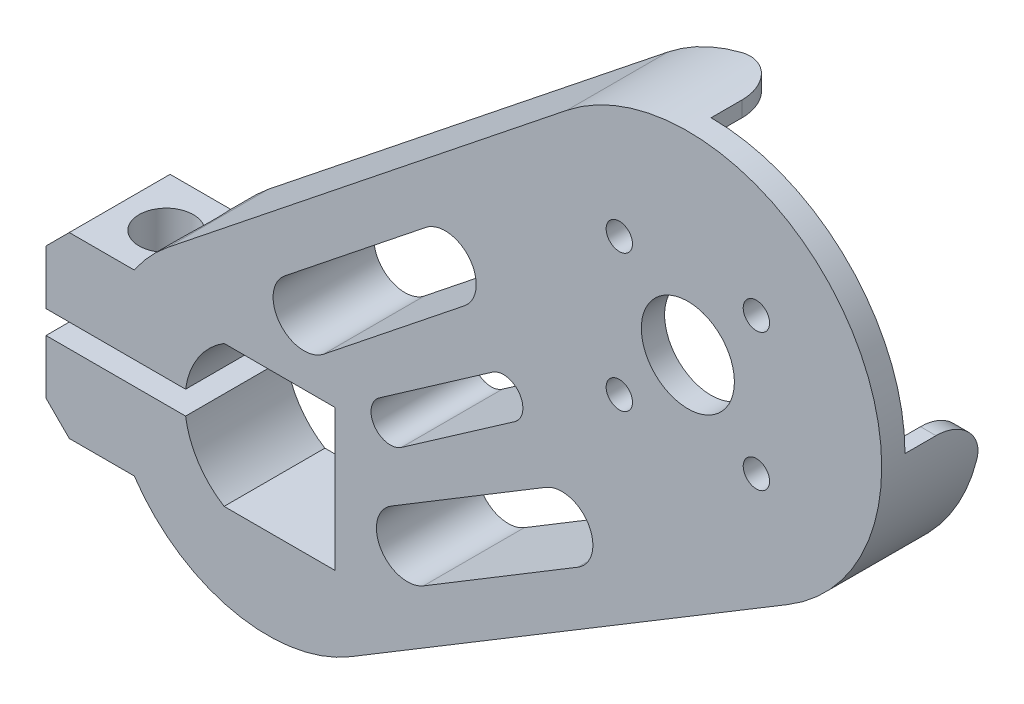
ISO-10303-21;
HEADER;
FILE_DESCRIPTION(('STEP AP214'),'2;1');
FILE_NAME('part.step','',(''),(''),'','','');
FILE_SCHEMA(('AUTOMOTIVE_DESIGN { 1 0 10303 214 1 1 1 1 }'));
ENDSEC;
DATA;
#1=APPLICATION_CONTEXT('core data for automotive mechanical design processes');
#2=APPLICATION_PROTOCOL_DEFINITION('international standard','automotive_design',2000,#1);
#3=PRODUCT_CONTEXT('',#1,'mechanical');
#4=PRODUCT('Part','Part','',(#3));
#5=PRODUCT_RELATED_PRODUCT_CATEGORY('part','',(#4));
#6=PRODUCT_DEFINITION_FORMATION('','',#4);
#7=PRODUCT_DEFINITION_CONTEXT('part definition',#1,'design');
#8=PRODUCT_DEFINITION('design','',#6,#7);
#9=PRODUCT_DEFINITION_SHAPE('','',#8);
#10=(LENGTH_UNIT() NAMED_UNIT(*) SI_UNIT(.MILLI.,.METRE.));
#11=(NAMED_UNIT(*) PLANE_ANGLE_UNIT() SI_UNIT($,.RADIAN.));
#12=(NAMED_UNIT(*) SI_UNIT($,.STERADIAN.) SOLID_ANGLE_UNIT());
#13=UNCERTAINTY_MEASURE_WITH_UNIT(LENGTH_MEASURE(1.E-05),#10,'distance_accuracy_value','');
#14=(GEOMETRIC_REPRESENTATION_CONTEXT(3) GLOBAL_UNCERTAINTY_ASSIGNED_CONTEXT((#13)) GLOBAL_UNIT_ASSIGNED_CONTEXT((#10,
#11,#12)) REPRESENTATION_CONTEXT('',''));
#15=CARTESIAN_POINT('',(0.,0.,0.));
#16=DIRECTION('',(0.,0.,1.));
#17=DIRECTION('',(1.,0.,0.));
#18=AXIS2_PLACEMENT_3D('',#15,#16,#17);
#19=CARTESIAN_POINT('',(-54.1729637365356,-37.6999999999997,3.));
#20=DIRECTION('',(0.,0.,-1.));
#21=DIRECTION('',(-1.,0.,0.));
#22=AXIS2_PLACEMENT_3D('',#19,#20,#21);
#23=CYLINDRICAL_SURFACE('',#22,20.7);
#24=CARTESIAN_POINT('',(-71.3845877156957,-26.1999999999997,2.00660270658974));
#25=CARTESIAN_POINT('',(-71.3163564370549,-26.0978782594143,1.97707616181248));
#26=CARTESIAN_POINT('',(-71.2474555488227,-25.9967275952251,1.94575992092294));
#27=CARTESIAN_POINT('',(-71.1084717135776,-25.7964955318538,1.87927173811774));
#28=CARTESIAN_POINT('',(-71.0383885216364,-25.6974145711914,1.84409898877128));
#29=CARTESIAN_POINT('',(-70.8262641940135,-25.4030025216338,1.73220021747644));
#30=CARTESIAN_POINT('',(-70.6827181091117,-25.2110546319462,1.64924993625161));
#31=CARTESIAN_POINT('',(-70.3921535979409,-24.8359137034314,1.46370538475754));
#32=CARTESIAN_POINT('',(-70.2451146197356,-24.6528315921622,1.36091703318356));
#33=CARTESIAN_POINT('',(-69.9519716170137,-24.2997926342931,1.13438904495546));
#34=CARTESIAN_POINT('',(-69.8058666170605,-24.1298188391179,1.01067714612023));
#35=CARTESIAN_POINT('',(-69.4772519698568,-23.7592060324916,0.702301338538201));
#36=CARTESIAN_POINT('',(-69.2960324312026,-23.5633475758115,0.510275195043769));
#37=CARTESIAN_POINT('',(-69.0367761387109,-23.2926114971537,0.193336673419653));
#38=CARTESIAN_POINT('',(-68.9525486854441,-23.2063000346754,0.0830271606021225));
#39=CARTESIAN_POINT('',(-68.7894782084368,-23.0418674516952,-0.147218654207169));
#40=CARTESIAN_POINT('',(-68.7106325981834,-22.9637423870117,-0.267150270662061));
#41=CARTESIAN_POINT('',(-68.55883486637,-22.8155075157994,-0.517788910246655));
#42=CARTESIAN_POINT('',(-68.4859603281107,-22.7454994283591,-0.648603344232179));
#43=CARTESIAN_POINT('',(-68.3486206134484,-22.6152491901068,-0.919130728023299));
#44=CARTESIAN_POINT('',(-68.2841511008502,-22.5550019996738,-1.05883903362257));
#45=CARTESIAN_POINT('',(-68.1649762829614,-22.4448309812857,-1.34635792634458));
#46=CARTESIAN_POINT('',(-68.1102749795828,-22.3949113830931,-1.4941718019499));
#47=CARTESIAN_POINT('',(-68.0119789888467,-22.3059732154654,-1.79661349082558));
#48=CARTESIAN_POINT('',(-67.9683822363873,-22.2669526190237,-1.95124003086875));
#49=CARTESIAN_POINT('',(-67.8986172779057,-22.2048944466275,-2.24385050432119));
#50=CARTESIAN_POINT('',(-67.8708665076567,-22.1803868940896,-2.3811485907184));
#51=CARTESIAN_POINT('',(-67.8249314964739,-22.1399641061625,-2.65857596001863));
#52=CARTESIAN_POINT('',(-67.806746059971,-22.1240477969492,-2.79870488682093));
#53=CARTESIAN_POINT('',(-67.7803107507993,-22.1009482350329,-3.0805259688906));
#54=CARTESIAN_POINT('',(-67.7720549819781,-22.0937597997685,-3.2222171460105));
#55=CARTESIAN_POINT('',(-67.7656268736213,-22.0881606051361,-3.50599911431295));
#56=CARTESIAN_POINT('',(-67.767453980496,-22.0897493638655,-3.64808988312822));
#57=CARTESIAN_POINT('',(-67.7804988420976,-22.10112025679,-3.91793234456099));
#58=CARTESIAN_POINT('',(-67.7908074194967,-22.1101091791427,-4.04576313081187));
#59=CARTESIAN_POINT('',(-67.8194801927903,-22.13520150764,-4.2998541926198));
#60=CARTESIAN_POINT('',(-67.8378468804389,-22.1513071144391,-4.42611396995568));
#61=CARTESIAN_POINT('',(-67.8823269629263,-22.1905114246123,-4.67608661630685));
#62=CARTESIAN_POINT('',(-67.9084364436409,-22.2136065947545,-4.79980073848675));
#63=CARTESIAN_POINT('',(-67.9680013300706,-22.2666423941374,-5.04399379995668));
#64=CARTESIAN_POINT('',(-68.0014594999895,-22.2965855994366,-5.16447150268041));
#65=CARTESIAN_POINT('',(-68.075575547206,-22.3634457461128,-5.40261724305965));
#66=CARTESIAN_POINT('',(-68.1163018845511,-22.4004292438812,-5.52024528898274));
#67=CARTESIAN_POINT('',(-68.2041139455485,-22.4809207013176,-5.75081904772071));
#68=CARTESIAN_POINT('',(-68.2512019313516,-22.5244309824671,-5.86376307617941));
#69=CARTESIAN_POINT('',(-68.4010013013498,-22.6643230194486,-6.19468279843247));
#70=CARTESIAN_POINT('',(-68.5123056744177,-22.7701169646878,-6.40492669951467));
#71=CARTESIAN_POINT('',(-68.7638826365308,-23.0156927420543,-6.8212651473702));
#72=CARTESIAN_POINT('',(-68.905933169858,-23.1578043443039,-7.02488178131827));
#73=CARTESIAN_POINT('',(-69.2034618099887,-23.4655384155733,-7.40246234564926));
#74=CARTESIAN_POINT('',(-69.3589506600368,-23.6311797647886,-7.57640221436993));
#75=CARTESIAN_POINT('',(-69.6417820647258,-23.9435517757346,-7.86015388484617));
#76=CARTESIAN_POINT('',(-69.7677874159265,-24.0864207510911,-7.9756540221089));
#77=CARTESIAN_POINT('',(-70.0215825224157,-24.3827432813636,-8.19011676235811));
#78=CARTESIAN_POINT('',(-70.1493732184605,-24.5362025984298,-8.28907026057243));
#79=CARTESIAN_POINT('',(-70.4047260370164,-24.8523831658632,-8.47169599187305));
#80=CARTESIAN_POINT('',(-70.5322877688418,-25.0151141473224,-8.55535176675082));
#81=CARTESIAN_POINT('',(-70.7853754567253,-25.3484196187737,-8.70864605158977));
#82=CARTESIAN_POINT('',(-70.910902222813,-25.518990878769,-8.77829027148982));
#83=CARTESIAN_POINT('',(-71.0939890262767,-25.7761020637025,-8.87194740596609));
#84=CARTESIAN_POINT('',(-71.1528189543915,-25.8600213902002,-8.90080090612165));
#85=CARTESIAN_POINT('',(-71.2694505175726,-26.0290680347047,-8.95571966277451));
#86=CARTESIAN_POINT('',(-71.327254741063,-26.1141908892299,-8.98179315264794));
#87=CARTESIAN_POINT('',(-71.3845877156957,-26.1999999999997,-9.00660270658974));
#88=B_SPLINE_CURVE_WITH_KNOTS('',3,(#24,#25,#26,#27,#28,#29,#30,#31,#32,#33,#34,#35,#36,#37,#38,
#39,#40,#41,#42,#43,#44,#45,#46,#47,#48,#49,#50,#51,#52,#53,#54,#55,#56,#57,#58,#59,#60,#61,#62,
#63,#64,#65,#66,#67,#68,#69,#70,#71,#72,#73,#74,#75,#76,#77,#78,#79,#80,#81,#82,#83,#84,#85,#86,
#87),.UNSPECIFIED.,.F.,.F.,(4,2,2,2,2,2,2,2,2,2,2,2,2,2,2,2,2,2,2,2,2,2,2,2,2,2,2,2,2,2,2,4),
(0.,0.378919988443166,0.757919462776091,1.51796189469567,2.28585600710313,3.05274000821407,
4.03483649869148,4.5246824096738,5.01429121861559,5.50949116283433,6.00443461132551,
6.49958036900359,6.99463397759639,7.42065714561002,7.84662705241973,8.27234389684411,
8.69803736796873,9.08326477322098,9.46861138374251,9.85376352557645,10.2390607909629,
10.6281997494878,11.0174774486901,11.7954504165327,12.6505535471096,13.5063467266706,
14.1737862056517,14.8415917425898,15.5101115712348,16.1783584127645,16.4977305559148,
16.8161289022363),.UNSPECIFIED.);
#89=CARTESIAN_POINT('',(-71.3845877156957,-26.1999999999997,2.00660270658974));
#90=VERTEX_POINT('',#89);
#91=CARTESIAN_POINT('',(-71.3845877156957,-26.1999999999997,-9.00660270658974));
#92=VERTEX_POINT('',#91);
#93=EDGE_CURVE('E395',#90,#92,#88,.T.);
#94=ORIENTED_EDGE('',*,*,#93,.F.);
#95=DIRECTION('',(0.,0.,1.));
#96=VECTOR('',#95,1.);
#97=CARTESIAN_POINT('',(-71.3845877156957,-26.1999999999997,-25.1514415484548));
#98=LINE('',#97,#96);
#99=CARTESIAN_POINT('',(-71.3845877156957,-26.1999999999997,3.));
#100=VERTEX_POINT('',#99);
#101=EDGE_CURVE('E469',#90,#100,#98,.T.);
#102=ORIENTED_EDGE('',*,*,#101,.T.);
#103=CARTESIAN_POINT('',(-54.1729637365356,-37.6999999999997,3.));
#104=DIRECTION('',(0.,0.,1.));
#105=DIRECTION('',(1.,0.,0.));
#106=AXIS2_PLACEMENT_3D('',#103,#104,#105);
#107=CIRCLE('',#106,20.7);
#108=CARTESIAN_POINT('',(-67.0788970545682,-21.5158446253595,3.));
#109=VERTEX_POINT('',#108);
#110=EDGE_CURVE('E591',#109,#100,#107,.T.);
#111=ORIENTED_EDGE('',*,*,#110,.F.);
#112=DIRECTION('',(0.,0.,-1.));
#113=VECTOR('',#112,1.);
#114=CARTESIAN_POINT('',(-67.0788970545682,-21.5158446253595,3.));
#115=LINE('',#114,#113);
#116=CARTESIAN_POINT('',(-67.0788970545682,-21.5158446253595,-10.));
#117=VERTEX_POINT('',#116);
#118=EDGE_CURVE('E603',#109,#117,#115,.T.);
#119=ORIENTED_EDGE('',*,*,#118,.T.);
#120=CARTESIAN_POINT('',(-54.1729637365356,-37.6999999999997,-10.));
#121=DIRECTION('',(0.,0.,-1.));
#122=DIRECTION('',(-1.,0.,0.));
#123=AXIS2_PLACEMENT_3D('',#120,#121,#122);
#124=CIRCLE('',#123,20.7);
#125=CARTESIAN_POINT('',(-71.3845877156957,-26.1999999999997,-10.));
#126=VERTEX_POINT('',#125);
#127=EDGE_CURVE('E499',#126,#117,#124,.T.);
#128=ORIENTED_EDGE('',*,*,#127,.F.);
#129=EDGE_CURVE('E470',#126,#92,#98,.T.);
#130=ORIENTED_EDGE('',*,*,#129,.T.);
#131=EDGE_LOOP('',(#94,#102,#111,#119,#128,#130));
#132=FACE_BOUND('',#131,.T.);
#133=ADVANCED_FACE('F37',(#132),#23,.T.);
#134=CARTESIAN_POINT('',(-73.7673018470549,25.,-3.5));
#135=DIRECTION('',(0.,-1.,0.));
#136=DIRECTION('',(1.,0.,0.));
#137=AXIS2_PLACEMENT_3D('',#134,#135,#136);
#138=CYLINDRICAL_SURFACE('',#137,3.50000000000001);
#139=CARTESIAN_POINT('',(-73.7673018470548,-36.1999999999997,-3.5));
#140=DIRECTION('',(0.,1.,0.));
#141=DIRECTION('',(-1.,0.,0.));
#142=AXIS2_PLACEMENT_3D('',#139,#140,#141);
#143=CIRCLE('',#142,3.50000000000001);
#144=CARTESIAN_POINT('',(-77.2673018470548,-36.1999999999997,-3.5));
#145=VERTEX_POINT('',#144);
#146=EDGE_CURVE('E851',#145,#145,#143,.T.);
#147=ORIENTED_EDGE('',*,*,#146,.F.);
#148=EDGE_LOOP('',(#147));
#149=FACE_BOUND('',#148,.T.);
#150=CARTESIAN_POINT('',(-73.7673018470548,-26.1999999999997,-3.5));
#151=DIRECTION('',(0.,1.,0.));
#152=DIRECTION('',(0.,0.,1.));
#153=AXIS2_PLACEMENT_3D('',#150,#151,#152);
#154=CIRCLE('',#153,3.50000000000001);
#155=CARTESIAN_POINT('',(-73.7673018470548,-26.1999999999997,0.));
#156=VERTEX_POINT('',#155);
#157=EDGE_CURVE('E849',#156,#156,#154,.T.);
#158=ORIENTED_EDGE('',*,*,#157,.T.);
#159=EDGE_LOOP('',(#158));
#160=FACE_BOUND('',#159,.T.);
#161=ADVANCED_FACE('F422',(#149,#160),#138,.F.);
#162=CARTESIAN_POINT('',(-71.3845877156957,-49.1999999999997,-9.00660270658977));
#163=CARTESIAN_POINT('',(-71.3163564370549,-49.3021217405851,-8.9770761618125));
#164=CARTESIAN_POINT('',(-71.2474555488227,-49.4032724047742,-8.94575992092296));
#165=CARTESIAN_POINT('',(-71.1084717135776,-49.6035044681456,-8.87927173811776));
#166=CARTESIAN_POINT('',(-71.0383885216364,-49.7025854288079,-8.8440989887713));
#167=CARTESIAN_POINT('',(-70.8262641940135,-49.9969974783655,-8.73220021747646));
#168=CARTESIAN_POINT('',(-70.6827181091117,-50.1889453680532,-8.64924993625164));
#169=CARTESIAN_POINT('',(-70.3921535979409,-50.564086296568,-8.46370538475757));
#170=CARTESIAN_POINT('',(-70.2451146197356,-50.7471684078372,-8.36091703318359));
#171=CARTESIAN_POINT('',(-69.9519716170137,-51.1002073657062,-8.13438904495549));
#172=CARTESIAN_POINT('',(-69.8058666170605,-51.2701811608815,-8.01067714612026));
#173=CARTESIAN_POINT('',(-69.4772519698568,-51.6407939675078,-7.70230133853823));
#174=CARTESIAN_POINT('',(-69.2960324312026,-51.8366524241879,-7.5102751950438));
#175=CARTESIAN_POINT('',(-69.0367761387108,-52.1073885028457,-7.19333667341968));
#176=CARTESIAN_POINT('',(-68.952548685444,-52.1936999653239,-7.08302716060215));
#177=CARTESIAN_POINT('',(-68.7894782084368,-52.3581325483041,-6.85278134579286));
#178=CARTESIAN_POINT('',(-68.7106325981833,-52.4362576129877,-6.73284972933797));
#179=CARTESIAN_POINT('',(-68.55883486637,-52.5844924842,-6.48221108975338));
#180=CARTESIAN_POINT('',(-68.4859603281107,-52.6545005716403,-6.35139665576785));
#181=CARTESIAN_POINT('',(-68.3486206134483,-52.7847508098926,-6.08086927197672));
#182=CARTESIAN_POINT('',(-68.2841511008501,-52.8449980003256,-5.94116096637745));
#183=CARTESIAN_POINT('',(-68.1649762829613,-52.9551690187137,-5.65364207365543));
#184=CARTESIAN_POINT('',(-68.1102749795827,-53.0050886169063,-5.50582819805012));
#185=CARTESIAN_POINT('',(-68.0119789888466,-53.094026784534,-5.20338650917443));
#186=CARTESIAN_POINT('',(-67.9683822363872,-53.1330473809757,-5.04875996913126));
#187=CARTESIAN_POINT('',(-67.8986172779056,-53.1951055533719,-4.75614949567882));
#188=CARTESIAN_POINT('',(-67.8708665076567,-53.2196131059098,-4.61885140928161));
#189=CARTESIAN_POINT('',(-67.8249314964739,-53.2600358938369,-4.34142403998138));
#190=CARTESIAN_POINT('',(-67.806746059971,-53.2759522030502,-4.20129511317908));
#191=CARTESIAN_POINT('',(-67.7803107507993,-53.2990517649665,-3.91947403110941));
#192=CARTESIAN_POINT('',(-67.7720549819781,-53.3062402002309,-3.77778285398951));
#193=CARTESIAN_POINT('',(-67.7656268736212,-53.3118393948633,-3.49400088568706));
#194=CARTESIAN_POINT('',(-67.767453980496,-53.3102506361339,-3.35191011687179));
#195=CARTESIAN_POINT('',(-67.7804988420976,-53.2988797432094,-3.08206765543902));
#196=CARTESIAN_POINT('',(-67.7908074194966,-53.2898908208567,-2.95423686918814));
#197=CARTESIAN_POINT('',(-67.8194801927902,-53.2647984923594,-2.70014580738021));
#198=CARTESIAN_POINT('',(-67.8378468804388,-53.2486928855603,-2.57388603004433));
#199=CARTESIAN_POINT('',(-67.8823269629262,-53.2094885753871,-2.32391338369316));
#200=CARTESIAN_POINT('',(-67.9084364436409,-53.1863934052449,-2.20019926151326));
#201=CARTESIAN_POINT('',(-67.9680013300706,-53.133357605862,-1.95600620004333));
#202=CARTESIAN_POINT('',(-68.0014594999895,-53.1034144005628,-1.83552849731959));
#203=CARTESIAN_POINT('',(-68.075575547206,-53.0365542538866,-1.59738275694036));
#204=CARTESIAN_POINT('',(-68.1163018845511,-52.9995707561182,-1.47975471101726));
#205=CARTESIAN_POINT('',(-68.2041139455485,-52.9190792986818,-1.24918095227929));
#206=CARTESIAN_POINT('',(-68.2512019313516,-52.8755690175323,-1.13623692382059));
#207=CARTESIAN_POINT('',(-68.4010013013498,-52.7356769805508,-0.805317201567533));
#208=CARTESIAN_POINT('',(-68.5123056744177,-52.6298830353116,-0.595073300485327));
#209=CARTESIAN_POINT('',(-68.7638826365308,-52.3843072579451,-0.178734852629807));
#210=CARTESIAN_POINT('',(-68.9059331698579,-52.2421956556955,0.0248817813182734));
#211=CARTESIAN_POINT('',(-69.2034618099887,-51.9344615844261,0.402462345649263));
#212=CARTESIAN_POINT('',(-69.3589506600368,-51.7688202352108,0.576402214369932));
#213=CARTESIAN_POINT('',(-69.6417820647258,-51.4564482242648,0.860153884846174));
#214=CARTESIAN_POINT('',(-69.7677874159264,-51.3135792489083,0.9756540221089));
#215=CARTESIAN_POINT('',(-70.0215825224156,-51.0172567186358,1.19011676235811));
#216=CARTESIAN_POINT('',(-70.1493732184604,-50.8637974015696,1.28907026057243));
#217=CARTESIAN_POINT('',(-70.4047260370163,-50.5476168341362,1.47169599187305));
#218=CARTESIAN_POINT('',(-70.5322877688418,-50.3848858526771,1.55535176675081));
#219=CARTESIAN_POINT('',(-70.7853754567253,-50.0515803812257,1.70864605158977));
#220=CARTESIAN_POINT('',(-70.910902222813,-49.8810091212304,1.77829027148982));
#221=CARTESIAN_POINT('',(-71.0939890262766,-49.6238979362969,1.87194740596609));
#222=CARTESIAN_POINT('',(-71.1528189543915,-49.5399786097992,1.90080090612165));
#223=CARTESIAN_POINT('',(-71.2694505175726,-49.3709319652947,1.95571966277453));
#224=CARTESIAN_POINT('',(-71.327254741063,-49.2858091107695,1.98179315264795));
#225=CARTESIAN_POINT('',(-71.3845877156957,-49.1999999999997,2.00660270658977));
#226=B_SPLINE_CURVE_WITH_KNOTS('',3,(#162,#163,#164,#165,#166,#167,#168,#169,#170,#171,#172,
#173,#174,#175,#176,#177,#178,#179,#180,#181,#182,#183,#184,#185,#186,#187,#188,#189,#190,#191,
#192,#193,#194,#195,#196,#197,#198,#199,#200,#201,#202,#203,#204,#205,#206,#207,#208,#209,#210,
#211,#212,#213,#214,#215,#216,#217,#218,#219,#220,#221,#222,#223,#224,#225),.UNSPECIFIED.,.F.,
.F.,(4,2,2,2,2,2,2,2,2,2,2,2,2,2,2,2,2,2,2,2,2,2,2,2,2,2,2,2,2,2,2,4),(0.,0.378919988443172,
0.757919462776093,1.51796189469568,2.28585600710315,3.05274000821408,4.03483649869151,
4.52468240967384,5.01429121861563,5.50949116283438,6.00443461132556,6.49958036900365,
6.99463397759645,7.42065714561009,7.84662705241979,8.27234389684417,8.69803736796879,
9.08326477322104,9.46861138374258,9.85376352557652,10.239060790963,10.6281997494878,
11.0174774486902,11.7954504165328,12.6505535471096,13.5063467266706,14.1737862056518,
14.8415917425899,15.5101115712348,16.1783584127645,16.4977305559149,16.8161289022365),.UNSPECIFIED.);
#227=CARTESIAN_POINT('',(-71.3845877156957,-49.1999999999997,-9.00660270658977));
#228=VERTEX_POINT('',#227);
#229=CARTESIAN_POINT('',(-71.3845877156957,-49.1999999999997,2.00660270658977));
#230=VERTEX_POINT('',#229);
#231=EDGE_CURVE('E430',#228,#230,#226,.T.);
#232=ORIENTED_EDGE('',*,*,#231,.F.);
#233=DIRECTION('',(0.,0.,1.));
#234=VECTOR('',#233,1.);
#235=CARTESIAN_POINT('',(-71.3845877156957,-49.1999999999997,-25.1514415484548));
#236=LINE('',#235,#234);
#237=CARTESIAN_POINT('',(-71.3845877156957,-49.1999999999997,-10.));
#238=VERTEX_POINT('',#237);
#239=EDGE_CURVE('E451',#238,#228,#236,.T.);
#240=ORIENTED_EDGE('',*,*,#239,.F.);
#241=CARTESIAN_POINT('',(-43.4809585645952,-55.4248702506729,-10.));
#242=VERTEX_POINT('',#241);
#243=EDGE_CURVE('E500',#242,#238,#124,.T.);
#244=ORIENTED_EDGE('',*,*,#243,.F.);
#245=DIRECTION('',(0.,0.,-1.));
#246=VECTOR('',#245,1.);
#247=CARTESIAN_POINT('',(-43.4809585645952,-55.4248702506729,3.));
#248=LINE('',#247,#246);
#249=CARTESIAN_POINT('',(-43.4809585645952,-55.4248702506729,3.));
#250=VERTEX_POINT('',#249);
#251=EDGE_CURVE('E601',#250,#242,#248,.T.);
#252=ORIENTED_EDGE('',*,*,#251,.F.);
#253=CARTESIAN_POINT('',(-71.3845877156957,-49.1999999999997,3.));
#254=VERTEX_POINT('',#253);
#255=EDGE_CURVE('E590',#254,#250,#107,.T.);
#256=ORIENTED_EDGE('',*,*,#255,.F.);
#257=EDGE_CURVE('E447',#230,#254,#236,.T.);
#258=ORIENTED_EDGE('',*,*,#257,.F.);
#259=EDGE_LOOP('',(#232,#240,#244,#252,#256,#258));
#260=FACE_BOUND('',#259,.T.);
#261=ADVANCED_FACE('F404',(#260),#23,.T.);
#262=CARTESIAN_POINT('',(-54.1729637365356,-37.6999999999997,3.));
#263=DIRECTION('',(0.,0.,-1.));
#264=DIRECTION('',(-1.,0.,0.));
#265=AXIS2_PLACEMENT_3D('',#262,#263,#264);
#266=CYLINDRICAL_SURFACE('',#265,10.7);
#267=DIRECTION('',(0.,0.,1.));
#268=VECTOR('',#267,1.);
#269=CARTESIAN_POINT('',(-64.7673018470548,-36.1999999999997,-10.));
#270=LINE('',#269,#268);
#271=CARTESIAN_POINT('',(-64.7673018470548,-36.1999999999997,-10.));
#272=VERTEX_POINT('',#271);
#273=CARTESIAN_POINT('',(-64.7673018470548,-36.1999999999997,3.));
#274=VERTEX_POINT('',#273);
#275=EDGE_CURVE('E485',#272,#274,#270,.T.);
#276=ORIENTED_EDGE('',*,*,#275,.F.);
#277=CARTESIAN_POINT('',(-54.1729637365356,-37.6999999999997,-10.));
#278=DIRECTION('',(0.,0.,-1.));
#279=DIRECTION('',(-1.,0.,0.));
#280=AXIS2_PLACEMENT_3D('',#277,#278,#279);
#281=CIRCLE('',#280,10.7);
#282=CARTESIAN_POINT('',(-59.8014626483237,-28.5999999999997,-10.));
#283=VERTEX_POINT('',#282);
#284=EDGE_CURVE('E510',#283,#272,#281,.F.);
#285=ORIENTED_EDGE('',*,*,#284,.F.);
#286=DIRECTION('',(0.,0.,-1.));
#287=VECTOR('',#286,1.);
#288=CARTESIAN_POINT('',(-59.8014626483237,-28.5999999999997,3.));
#289=LINE('',#288,#287);
#290=CARTESIAN_POINT('',(-59.8014626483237,-28.5999999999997,3.));
#291=VERTEX_POINT('',#290);
#292=EDGE_CURVE('E575',#291,#283,#289,.T.);
#293=ORIENTED_EDGE('',*,*,#292,.F.);
#294=CARTESIAN_POINT('',(-54.1729637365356,-37.6999999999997,3.));
#295=DIRECTION('',(0.,0.,1.));
#296=DIRECTION('',(1.,0.,0.));
#297=AXIS2_PLACEMENT_3D('',#294,#295,#296);
#298=CIRCLE('',#297,10.7);
#299=EDGE_CURVE('E565',#291,#274,#298,.T.);
#300=ORIENTED_EDGE('',*,*,#299,.T.);
#301=EDGE_LOOP('',(#276,#285,#293,#300));
#302=FACE_BOUND('',#301,.T.);
#303=ADVANCED_FACE('F715',(#302),#266,.F.);
#304=CARTESIAN_POINT('',(0.,0.,3.));
#305=DIRECTION('',(0.,0.,1.));
#306=DIRECTION('',(1.,0.,0.));
#307=AXIS2_PLACEMENT_3D('',#304,#305,#306);
#308=PLANE('',#307);
#309=CARTESIAN_POINT('',(-23.7760405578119,-16.5657725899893,3.));
#310=DIRECTION('',(0.,0.,-1.));
#311=DIRECTION('',(-1.,0.,0.));
#312=AXIS2_PLACEMENT_3D('',#309,#310,#311);
#313=CIRCLE('',#312,2.5);
#314=CARTESIAN_POINT('',(-25.2052759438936,-14.5146055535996,3.));
#315=VERTEX_POINT('',#314);
#316=CARTESIAN_POINT('',(-22.3468051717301,-18.616939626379,3.));
#317=VERTEX_POINT('',#316);
#318=EDGE_CURVE('E329',#315,#317,#313,.T.);
#319=ORIENTED_EDGE('',*,*,#318,.T.);
#320=DIRECTION('',(-0.820466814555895,-0.571694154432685,0.));
#321=VECTOR('',#320,1.);
#322=CARTESIAN_POINT('',(-22.3468051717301,-18.616939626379,3.));
#323=LINE('',#322,#321);
#324=CARTESIAN_POINT('',(-36.9281264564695,-28.7770777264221,3.));
#325=VERTEX_POINT('',#324);
#326=EDGE_CURVE('E332',#317,#325,#323,.T.);
#327=ORIENTED_EDGE('',*,*,#326,.T.);
#328=CARTESIAN_POINT('',(-38.3573618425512,-26.7259106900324,3.));
#329=DIRECTION('',(0.,0.,-1.));
#330=DIRECTION('',(-1.,0.,0.));
#331=AXIS2_PLACEMENT_3D('',#328,#329,#330);
#332=CIRCLE('',#331,2.5);
#333=CARTESIAN_POINT('',(-39.7865972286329,-24.6747436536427,3.));
#334=VERTEX_POINT('',#333);
#335=EDGE_CURVE('E336',#325,#334,#332,.T.);
#336=ORIENTED_EDGE('',*,*,#335,.T.);
#337=DIRECTION('',(0.820466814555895,0.571694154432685,0.));
#338=VECTOR('',#337,1.);
#339=CARTESIAN_POINT('',(-25.2052759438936,-14.5146055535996,3.));
#340=LINE('',#339,#338);
#341=EDGE_CURVE('E339',#334,#315,#340,.T.);
#342=ORIENTED_EDGE('',*,*,#341,.T.);
#343=EDGE_LOOP('',(#319,#327,#336,#342));
#344=FACE_BOUND('',#343,.T.);
#345=CARTESIAN_POINT('',(-16.2484810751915,-27.3554316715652,3.));
#346=DIRECTION('',(0.,0.,-1.));
#347=DIRECTION('',(1.,0.,0.));
#348=AXIS2_PLACEMENT_3D('',#345,#346,#347);
#349=CIRCLE('',#348,4.00000000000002);
#350=CARTESIAN_POINT('',(-18.3185913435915,-23.9327655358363,3.));
#351=VERTEX_POINT('',#350);
#352=CARTESIAN_POINT('',(-14.1783708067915,-30.778097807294,3.));
#353=VERTEX_POINT('',#352);
#354=EDGE_CURVE('E289',#351,#353,#349,.T.);
#355=ORIENTED_EDGE('',*,*,#354,.T.);
#356=DIRECTION('',(-0.855666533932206,-0.5175275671,0.));
#357=VECTOR('',#356,1.);
#358=CARTESIAN_POINT('',(-14.1783708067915,-30.778097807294,3.));
#359=LINE('',#358,#357);
#360=CARTESIAN_POINT('',(-34.0894767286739,-42.8208104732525,3.));
#361=VERTEX_POINT('',#360);
#362=EDGE_CURVE('E301',#353,#361,#359,.T.);
#363=ORIENTED_EDGE('',*,*,#362,.T.);
#364=CARTESIAN_POINT('',(-36.1595869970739,-39.3981443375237,3.));
#365=DIRECTION('',(0.,0.,-1.));
#366=DIRECTION('',(1.,0.,0.));
#367=AXIS2_PLACEMENT_3D('',#364,#365,#366);
#368=CIRCLE('',#367,4.00000000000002);
#369=CARTESIAN_POINT('',(-38.2296972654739,-35.9754782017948,3.));
#370=VERTEX_POINT('',#369);
#371=EDGE_CURVE('E305',#361,#370,#368,.T.);
#372=ORIENTED_EDGE('',*,*,#371,.T.);
#373=DIRECTION('',(0.855666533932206,0.517527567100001,0.));
#374=VECTOR('',#373,1.);
#375=CARTESIAN_POINT('',(-18.3185913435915,-23.9327655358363,3.));
#376=LINE('',#375,#374);
#377=EDGE_CURVE('E297',#370,#351,#376,.T.);
#378=ORIENTED_EDGE('',*,*,#377,.T.);
#379=EDGE_LOOP('',(#355,#363,#372,#378));
#380=FACE_BOUND('',#379,.T.);
#381=CARTESIAN_POINT('',(-31.2909193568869,-5.76727771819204,3.));
#382=DIRECTION('',(0.,0.,-1.));
#383=DIRECTION('',(-1.,0.,0.));
#384=AXIS2_PLACEMENT_3D('',#381,#382,#383);
#385=CIRCLE('',#384,4.00000000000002);
#386=CARTESIAN_POINT('',(-33.7848195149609,-2.63990469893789,3.));
#387=VERTEX_POINT('',#386);
#388=CARTESIAN_POINT('',(-28.797019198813,-8.89465073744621,3.));
#389=VERTEX_POINT('',#388);
#390=EDGE_CURVE('E361',#387,#389,#385,.T.);
#391=ORIENTED_EDGE('',*,*,#390,.T.);
#392=DIRECTION('',(-0.781843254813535,-0.623475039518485,0.));
#393=VECTOR('',#392,1.);
#394=CARTESIAN_POINT('',(-28.797019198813,-8.89465073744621,3.));
#395=LINE('',#394,#393);
#396=CARTESIAN_POINT('',(-46.9902793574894,-23.4027295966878,3.));
#397=VERTEX_POINT('',#396);
#398=EDGE_CURVE('E364',#389,#397,#395,.T.);
#399=ORIENTED_EDGE('',*,*,#398,.T.);
#400=CARTESIAN_POINT('',(-49.4841795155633,-20.2753565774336,3.));
#401=DIRECTION('',(0.,0.,-1.));
#402=DIRECTION('',(-1.,0.,0.));
#403=AXIS2_PLACEMENT_3D('',#400,#401,#402);
#404=CIRCLE('',#403,4.00000000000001);
#405=CARTESIAN_POINT('',(-51.9780796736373,-17.1479835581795,3.));
#406=VERTEX_POINT('',#405);
#407=EDGE_CURVE('E368',#397,#406,#404,.T.);
#408=ORIENTED_EDGE('',*,*,#407,.T.);
#409=DIRECTION('',(0.781843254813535,0.623475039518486,0.));
#410=VECTOR('',#409,1.);
#411=CARTESIAN_POINT('',(-33.7848195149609,-2.63990469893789,3.));
#412=LINE('',#411,#410);
#413=EDGE_CURVE('E371',#406,#387,#412,.T.);
#414=ORIENTED_EDGE('',*,*,#413,.T.);
#415=EDGE_LOOP('',(#391,#399,#408,#414));
#416=FACE_BOUND('',#415,.T.);
#417=DIRECTION('',(0.,-1.,0.));
#418=VECTOR('',#417,1.);
#419=CARTESIAN_POINT('',(-82.7673018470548,-39.1999999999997,3.));
#420=LINE('',#419,#418);
#421=CARTESIAN_POINT('',(-82.7673018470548,-39.1999999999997,3.));
#422=VERTEX_POINT('',#421);
#423=CARTESIAN_POINT('',(-82.7673018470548,-46.1999999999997,3.));
#424=VERTEX_POINT('',#423);
#425=EDGE_CURVE('E437',#422,#424,#420,.T.);
#426=ORIENTED_EDGE('',*,*,#425,.T.);
#427=DIRECTION('',(-0.707106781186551,0.707106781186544,0.));
#428=VECTOR('',#427,1.);
#429=CARTESIAN_POINT('',(-64.4836509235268,-64.4836509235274,3.));
#430=LINE('',#429,#428);
#431=CARTESIAN_POINT('',(-79.7673018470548,-49.1999999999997,3.));
#432=VERTEX_POINT('',#431);
#433=EDGE_CURVE('E613',#424,#432,#430,.F.);
#434=ORIENTED_EDGE('',*,*,#433,.T.);
#435=DIRECTION('',(1.,0.,0.));
#436=VECTOR('',#435,1.);
#437=CARTESIAN_POINT('',(-82.7673018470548,-49.1999999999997,3.));
#438=LINE('',#437,#436);
#439=EDGE_CURVE('E440',#432,#254,#438,.T.);
#440=ORIENTED_EDGE('',*,*,#439,.T.);
#441=ORIENTED_EDGE('',*,*,#255,.T.);
#442=DIRECTION('',(0.856273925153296,0.516521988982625,0.));
#443=VECTOR('',#442,1.);
#444=CARTESIAN_POINT('',(12.9130497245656,-21.4068481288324,3.));
#445=LINE('',#444,#443);
#446=CARTESIAN_POINT('',(12.9130497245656,-21.4068481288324,3.));
#447=VERTEX_POINT('',#446);
#448=EDGE_CURVE('E594',#250,#447,#445,.T.);
#449=ORIENTED_EDGE('',*,*,#448,.T.);
#450=CARTESIAN_POINT('',(0.,0.,3.));
#451=DIRECTION('',(0.,0.,1.));
#452=DIRECTION('',(1.,0.,0.));
#453=AXIS2_PLACEMENT_3D('',#450,#451,#452);
#454=CIRCLE('',#453,25.);
#455=CARTESIAN_POINT('',(-15.5868759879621,19.5460813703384,3.));
#456=VERTEX_POINT('',#455);
#457=EDGE_CURVE('E585',#447,#456,#454,.T.);
#458=ORIENTED_EDGE('',*,*,#457,.T.);
#459=DIRECTION('',(-0.781843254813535,-0.623475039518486,0.));
#460=VECTOR('',#459,1.);
#461=CARTESIAN_POINT('',(-67.0788970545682,-21.5158446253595,3.));
#462=LINE('',#461,#460);
#463=EDGE_CURVE('E588',#456,#109,#462,.T.);
#464=ORIENTED_EDGE('',*,*,#463,.T.);
#465=ORIENTED_EDGE('',*,*,#110,.T.);
#466=DIRECTION('',(-1.,0.,0.));
#467=VECTOR('',#466,1.);
#468=CARTESIAN_POINT('',(-82.7673018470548,-26.1999999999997,3.));
#469=LINE('',#468,#467);
#470=CARTESIAN_POINT('',(-79.7673018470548,-26.1999999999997,3.));
#471=VERTEX_POINT('',#470);
#472=EDGE_CURVE('E454',#100,#471,#469,.T.);
#473=ORIENTED_EDGE('',*,*,#472,.T.);
#474=DIRECTION('',(0.707106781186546,0.707106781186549,0.));
#475=VECTOR('',#474,1.);
#476=CARTESIAN_POINT('',(-26.7836509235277,26.7836509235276,3.));
#477=LINE('',#476,#475);
#478=CARTESIAN_POINT('',(-82.7673018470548,-29.1999999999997,3.));
#479=VERTEX_POINT('',#478);
#480=EDGE_CURVE('E611',#471,#479,#477,.F.);
#481=ORIENTED_EDGE('',*,*,#480,.T.);
#482=DIRECTION('',(0.,-1.,0.));
#483=VECTOR('',#482,1.);
#484=CARTESIAN_POINT('',(-82.7673018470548,-36.1999999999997,3.));
#485=LINE('',#484,#483);
#486=CARTESIAN_POINT('',(-82.7673018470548,-36.1999999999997,3.));
#487=VERTEX_POINT('',#486);
#488=EDGE_CURVE('E457',#479,#487,#485,.T.);
#489=ORIENTED_EDGE('',*,*,#488,.T.);
#490=DIRECTION('',(-1.,0.,0.));
#491=VECTOR('',#490,1.);
#492=CARTESIAN_POINT('',(-74.8185443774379,-36.1999999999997,3.));
#493=LINE('',#492,#491);
#494=EDGE_CURVE('E478',#274,#487,#493,.T.);
#495=ORIENTED_EDGE('',*,*,#494,.F.);
#496=ORIENTED_EDGE('',*,*,#299,.F.);
#497=DIRECTION('',(-1.,0.,0.));
#498=VECTOR('',#497,1.);
#499=CARTESIAN_POINT('',(-45.4729637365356,-28.5999999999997,3.));
#500=LINE('',#499,#498);
#501=CARTESIAN_POINT('',(-45.4729637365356,-28.5999999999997,3.));
#502=VERTEX_POINT('',#501);
#503=EDGE_CURVE('E573',#502,#291,#500,.T.);
#504=ORIENTED_EDGE('',*,*,#503,.F.);
#505=DIRECTION('',(0.,1.,0.));
#506=VECTOR('',#505,1.);
#507=CARTESIAN_POINT('',(-45.4729637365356,-46.7999999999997,3.));
#508=LINE('',#507,#506);
#509=CARTESIAN_POINT('',(-45.4729637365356,-46.7999999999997,3.));
#510=VERTEX_POINT('',#509);
#511=EDGE_CURVE('E570',#510,#502,#508,.T.);
#512=ORIENTED_EDGE('',*,*,#511,.F.);
#513=DIRECTION('',(1.,0.,0.));
#514=VECTOR('',#513,1.);
#515=CARTESIAN_POINT('',(-59.8014626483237,-46.7999999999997,3.));
#516=LINE('',#515,#514);
#517=CARTESIAN_POINT('',(-59.8014626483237,-46.7999999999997,3.));
#518=VERTEX_POINT('',#517);
#519=EDGE_CURVE('E568',#518,#510,#516,.T.);
#520=ORIENTED_EDGE('',*,*,#519,.F.);
#521=CARTESIAN_POINT('',(-64.7673018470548,-39.1999999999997,3.));
#522=VERTEX_POINT('',#521);
#523=EDGE_CURVE('E562',#522,#518,#298,.T.);
#524=ORIENTED_EDGE('',*,*,#523,.F.);
#525=DIRECTION('',(1.,0.,0.));
#526=VECTOR('',#525,1.);
#527=CARTESIAN_POINT('',(-74.8185443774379,-39.1999999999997,3.));
#528=LINE('',#527,#526);
#529=EDGE_CURVE('E473',#422,#522,#528,.T.);
#530=ORIENTED_EDGE('',*,*,#529,.F.);
#531=EDGE_LOOP('',(#426,#434,#440,#441,#449,#458,#464,#465,#473,#481,#489,#495,#496,#504,#512,
#520,#524,#530));
#532=FACE_BOUND('',#531,.T.);
#533=CARTESIAN_POINT('',(-8.83883476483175,-8.83883476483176,3.));
#534=DIRECTION('',(0.,0.,1.));
#535=DIRECTION('',(1.,0.,0.));
#536=AXIS2_PLACEMENT_3D('',#533,#534,#535);
#537=CIRCLE('',#536,1.7);
#538=CARTESIAN_POINT('',(-7.13883476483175,-8.83883476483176,3.));
#539=VERTEX_POINT('',#538);
#540=EDGE_CURVE('E541',#539,#539,#537,.T.);
#541=ORIENTED_EDGE('',*,*,#540,.F.);
#542=EDGE_LOOP('',(#541));
#543=FACE_BOUND('',#542,.T.);
#544=CARTESIAN_POINT('',(8.83883476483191,8.83883476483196,3.));
#545=DIRECTION('',(0.,0.,1.));
#546=DIRECTION('',(1.,0.,0.));
#547=AXIS2_PLACEMENT_3D('',#544,#545,#546);
#548=CIRCLE('',#547,1.7);
#549=CARTESIAN_POINT('',(10.5388347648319,8.83883476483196,3.));
#550=VERTEX_POINT('',#549);
#551=EDGE_CURVE('E553',#550,#550,#548,.T.);
#552=ORIENTED_EDGE('',*,*,#551,.F.);
#553=EDGE_LOOP('',(#552));
#554=FACE_BOUND('',#553,.T.);
#555=CARTESIAN_POINT('',(-8.83883476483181,8.83883476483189,3.));
#556=DIRECTION('',(0.,0.,1.));
#557=DIRECTION('',(1.,0.,0.));
#558=AXIS2_PLACEMENT_3D('',#555,#556,#557);
#559=CIRCLE('',#558,1.7);
#560=CARTESIAN_POINT('',(-7.13883476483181,8.83883476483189,3.));
#561=VERTEX_POINT('',#560);
#562=EDGE_CURVE('E559',#561,#561,#559,.T.);
#563=ORIENTED_EDGE('',*,*,#562,.F.);
#564=EDGE_LOOP('',(#563));
#565=FACE_BOUND('',#564,.T.);
#566=CARTESIAN_POINT('',(8.83883476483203,-8.83883476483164,3.));
#567=DIRECTION('',(0.,0.,1.));
#568=DIRECTION('',(1.,0.,0.));
#569=AXIS2_PLACEMENT_3D('',#566,#567,#568);
#570=CIRCLE('',#569,1.7);
#571=CARTESIAN_POINT('',(10.538834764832,-8.83883476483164,3.));
#572=VERTEX_POINT('',#571);
#573=EDGE_CURVE('E547',#572,#572,#570,.T.);
#574=ORIENTED_EDGE('',*,*,#573,.F.);
#575=EDGE_LOOP('',(#574));
#576=FACE_BOUND('',#575,.T.);
#577=CARTESIAN_POINT('',(0.,0.,3.));
#578=DIRECTION('',(0.,0.,1.));
#579=DIRECTION('',(1.,0.,0.));
#580=AXIS2_PLACEMENT_3D('',#577,#578,#579);
#581=CIRCLE('',#580,6.);
#582=CARTESIAN_POINT('',(6.,0.,3.));
#583=VERTEX_POINT('',#582);
#584=EDGE_CURVE('E535',#583,#583,#581,.T.);
#585=ORIENTED_EDGE('',*,*,#584,.F.);
#586=EDGE_LOOP('',(#585));
#587=FACE_BOUND('',#586,.T.);
#588=ADVANCED_FACE('F307',(#344,#380,#416,#532,#543,#554,#565,#576,#587),#308,.T.);
#589=CARTESIAN_POINT('',(0.,0.,0.));
#590=DIRECTION('',(0.,0.,1.));
#591=DIRECTION('',(1.,0.,0.));
#592=AXIS2_PLACEMENT_3D('',#589,#590,#591);
#593=PLANE('',#592);
#594=CARTESIAN_POINT('',(0.,0.,0.));
#595=DIRECTION('',(0.,0.,-1.));
#596=DIRECTION('',(-1.,0.,0.));
#597=AXIS2_PLACEMENT_3D('',#594,#595,#596);
#598=CIRCLE('',#597,23.);
#599=CARTESIAN_POINT('',(23.,1.50920942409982E-13,0.));
#600=VERTEX_POINT('',#599);
#601=CARTESIAN_POINT('',(0.,23.,0.));
#602=VERTEX_POINT('',#601);
#603=EDGE_CURVE('E487',#600,#602,#598,.T.);
#604=ORIENTED_EDGE('',*,*,#603,.T.);
#605=DIRECTION('',(0.,1.,0.));
#606=VECTOR('',#605,1.);
#607=CARTESIAN_POINT('',(0.,0.,0.));
#608=LINE('',#607,#606);
#609=CARTESIAN_POINT('',(0.,25.,0.));
#610=VERTEX_POINT('',#609);
#611=EDGE_CURVE('E493',#602,#610,#608,.T.);
#612=ORIENTED_EDGE('',*,*,#611,.T.);
#613=CARTESIAN_POINT('',(0.,0.,0.));
#614=DIRECTION('',(0.,0.,1.));
#615=DIRECTION('',(1.,0.,0.));
#616=AXIS2_PLACEMENT_3D('',#613,#614,#615);
#617=CIRCLE('',#616,25.);
#618=CARTESIAN_POINT('',(25.,1.6306400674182E-13,0.));
#619=VERTEX_POINT('',#618);
#620=EDGE_CURVE('E584',#619,#610,#617,.T.);
#621=ORIENTED_EDGE('',*,*,#620,.F.);
#622=DIRECTION('',(1.,0.,0.));
#623=VECTOR('',#622,1.);
#624=CARTESIAN_POINT('',(0.,0.,0.));
#625=LINE('',#624,#623);
#626=EDGE_CURVE('E522',#600,#619,#625,.T.);
#627=ORIENTED_EDGE('',*,*,#626,.F.);
#628=EDGE_LOOP('',(#604,#612,#621,#627));
#629=FACE_BOUND('',#628,.T.);
#630=CARTESIAN_POINT('',(-8.83883476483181,8.83883476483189,0.));
#631=DIRECTION('',(0.,0.,1.));
#632=DIRECTION('',(1.,0.,0.));
#633=AXIS2_PLACEMENT_3D('',#630,#631,#632);
#634=CIRCLE('',#633,1.7);
#635=CARTESIAN_POINT('',(-7.13883476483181,8.83883476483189,0.));
#636=VERTEX_POINT('',#635);
#637=EDGE_CURVE('E556',#636,#636,#634,.T.);
#638=ORIENTED_EDGE('',*,*,#637,.T.);
#639=EDGE_LOOP('',(#638));
#640=FACE_BOUND('',#639,.T.);
#641=CARTESIAN_POINT('',(8.83883476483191,8.83883476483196,0.));
#642=DIRECTION('',(0.,0.,1.));
#643=DIRECTION('',(1.,0.,0.));
#644=AXIS2_PLACEMENT_3D('',#641,#642,#643);
#645=CIRCLE('',#644,1.7);
#646=CARTESIAN_POINT('',(10.5388347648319,8.83883476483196,0.));
#647=VERTEX_POINT('',#646);
#648=EDGE_CURVE('E550',#647,#647,#645,.T.);
#649=ORIENTED_EDGE('',*,*,#648,.T.);
#650=EDGE_LOOP('',(#649));
#651=FACE_BOUND('',#650,.T.);
#652=CARTESIAN_POINT('',(8.83883476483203,-8.83883476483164,0.));
#653=DIRECTION('',(0.,0.,1.));
#654=DIRECTION('',(1.,0.,0.));
#655=AXIS2_PLACEMENT_3D('',#652,#653,#654);
#656=CIRCLE('',#655,1.7);
#657=CARTESIAN_POINT('',(10.538834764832,-8.83883476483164,0.));
#658=VERTEX_POINT('',#657);
#659=EDGE_CURVE('E544',#658,#658,#656,.T.);
#660=ORIENTED_EDGE('',*,*,#659,.T.);
#661=EDGE_LOOP('',(#660));
#662=FACE_BOUND('',#661,.T.);
#663=CARTESIAN_POINT('',(-8.83883476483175,-8.83883476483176,0.));
#664=DIRECTION('',(0.,0.,1.));
#665=DIRECTION('',(1.,0.,0.));
#666=AXIS2_PLACEMENT_3D('',#663,#664,#665);
#667=CIRCLE('',#666,1.7);
#668=CARTESIAN_POINT('',(-7.13883476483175,-8.83883476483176,0.));
#669=VERTEX_POINT('',#668);
#670=EDGE_CURVE('E538',#669,#669,#667,.T.);
#671=ORIENTED_EDGE('',*,*,#670,.T.);
#672=EDGE_LOOP('',(#671));
#673=FACE_BOUND('',#672,.T.);
#674=CARTESIAN_POINT('',(0.,0.,0.));
#675=DIRECTION('',(0.,0.,1.));
#676=DIRECTION('',(1.,0.,0.));
#677=AXIS2_PLACEMENT_3D('',#674,#675,#676);
#678=CIRCLE('',#677,6.);
#679=CARTESIAN_POINT('',(6.,0.,0.));
#680=VERTEX_POINT('',#679);
#681=EDGE_CURVE('E534',#680,#680,#678,.T.);
#682=ORIENTED_EDGE('',*,*,#681,.T.);
#683=EDGE_LOOP('',(#682));
#684=FACE_BOUND('',#683,.T.);
#685=ADVANCED_FACE('F647',(#629,#640,#651,#662,#673,#684),#593,.F.);
#686=CARTESIAN_POINT('',(0.,0.,3.));
#687=DIRECTION('',(0.,0.,-1.));
#688=DIRECTION('',(-1.,0.,0.));
#689=AXIS2_PLACEMENT_3D('',#686,#687,#688);
#690=CYLINDRICAL_SURFACE('',#689,25.);
#691=CARTESIAN_POINT('',(0.,0.,-10.));
#692=DIRECTION('',(0.,0.,-1.));
#693=DIRECTION('',(-1.,0.,0.));
#694=AXIS2_PLACEMENT_3D('',#691,#692,#693);
#695=CIRCLE('',#694,25.);
#696=CARTESIAN_POINT('',(24.2693221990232,-5.99999999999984,-10.));
#697=VERTEX_POINT('',#696);
#698=CARTESIAN_POINT('',(12.9130497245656,-21.4068481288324,-10.));
#699=VERTEX_POINT('',#698);
#700=EDGE_CURVE('E492',#697,#699,#695,.T.);
#701=ORIENTED_EDGE('',*,*,#700,.F.);
#702=CARTESIAN_POINT('',(24.2693221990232,-5.99999999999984,-10.));
#703=CARTESIAN_POINT('',(24.3097289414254,-5.83662677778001,-10.0000190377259));
#704=CARTESIAN_POINT('',(24.3484581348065,-5.67282548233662,-9.99332770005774));
#705=CARTESIAN_POINT('',(24.4223957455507,-5.34551430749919,-9.96645253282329));
#706=CARTESIAN_POINT('',(24.4576036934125,-5.18200446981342,-9.94626690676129));
#707=CARTESIAN_POINT('',(24.52431138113,-4.85652109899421,-9.89234019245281));
#708=CARTESIAN_POINT('',(24.5558123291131,-4.69454708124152,-9.85860353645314));
#709=CARTESIAN_POINT('',(24.6150526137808,-4.37331048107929,-9.77765620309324));
#710=CARTESIAN_POINT('',(24.642792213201,-4.21404770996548,-9.73044646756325));
#711=CARTESIAN_POINT('',(24.6945602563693,-3.89925318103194,-9.62268394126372));
#712=CARTESIAN_POINT('',(24.7185840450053,-3.74372630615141,-9.5621146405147));
#713=CARTESIAN_POINT('',(24.7629888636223,-3.43777371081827,-9.42797443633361));
#714=CARTESIAN_POINT('',(24.7833685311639,-3.28734991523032,-9.35439869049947));
#715=CARTESIAN_POINT('',(24.8206381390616,-2.99297828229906,-9.19478869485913));
#716=CARTESIAN_POINT('',(24.8375310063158,-2.84902509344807,-9.10876499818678));
#717=CARTESIAN_POINT('',(24.8681023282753,-2.56854030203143,-8.92475655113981));
#718=CARTESIAN_POINT('',(24.881779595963,-2.43201145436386,-8.82676740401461));
#719=CARTESIAN_POINT('',(24.9060304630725,-2.16950714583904,-8.62111486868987));
#720=CARTESIAN_POINT('',(24.9166480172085,-2.04340296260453,-8.51362088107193));
#721=CARTESIAN_POINT('',(24.9353866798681,-1.80037598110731,-8.28842763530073));
#722=CARTESIAN_POINT('',(24.9435068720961,-1.68345656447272,-8.17072465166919));
#723=CARTESIAN_POINT('',(24.9575999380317,-1.45971685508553,-7.92597979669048));
#724=CARTESIAN_POINT('',(24.9635729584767,-1.35289587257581,-7.79893856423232));
#725=CARTESIAN_POINT('',(24.9737389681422,-1.15007786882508,-7.53635231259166));
#726=CARTESIAN_POINT('',(24.9779313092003,-1.05408479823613,-7.40080421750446));
#727=CARTESIAN_POINT('',(24.9849140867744,-0.873110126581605,-7.12135791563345));
#728=CARTESIAN_POINT('',(24.9876959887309,-0.788197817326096,-6.97741461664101));
#729=CARTESIAN_POINT('',(24.9921682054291,-0.630666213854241,-6.68293533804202));
#730=CARTESIAN_POINT('',(24.9938585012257,-0.55804713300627,-6.53239924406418));
#731=CARTESIAN_POINT('',(24.9964641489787,-0.425640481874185,-6.22584217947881));
#732=CARTESIAN_POINT('',(24.9973798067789,-0.36584785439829,-6.06982339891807));
#733=CARTESIAN_POINT('',(24.9987096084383,-0.259486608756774,-5.75339303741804));
#734=CARTESIAN_POINT('',(24.9991238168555,-0.212916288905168,-5.5929820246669));
#735=CARTESIAN_POINT('',(24.9998001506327,-0.115665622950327,-5.19689569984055));
#736=CARTESIAN_POINT('',(24.9999136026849,-0.0723048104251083,-4.95936041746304));
#737=CARTESIAN_POINT('',(24.9999867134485,-0.0289354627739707,-4.6007572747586));
#738=CARTESIAN_POINT('',(24.9999949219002,-0.0180910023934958,-4.48088788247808));
#739=CARTESIAN_POINT('',(25.000000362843,-0.00362349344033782,-4.24069120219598));
#740=CARTESIAN_POINT('',(24.9999975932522,-1.81478684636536E-06,-4.1203638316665));
#741=CARTESIAN_POINT('',(25.,1.63041825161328E-13,-4.));
#742=B_SPLINE_CURVE_WITH_KNOTS('',3,(#702,#703,#704,#705,#706,#707,#708,#709,#710,#711,#712,
#713,#714,#715,#716,#717,#718,#719,#720,#721,#722,#723,#724,#725,#726,#727,#728,#729,#730,#731,
#732,#733,#734,#735,#736,#737,#738,#739,#740,#741),.UNSPECIFIED.,.F.,.F.,(4,2,2,2,2,2,2,2,2,2,2,
2,2,2,2,2,2,2,2,4),(0.,0.504764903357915,1.00959701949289,1.51426415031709,2.01889601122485,
2.52415503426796,3.02960256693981,3.53462407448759,4.03983171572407,4.53737167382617,
5.03509396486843,5.5327822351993,6.03065150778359,6.53149846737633,7.03235411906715,
7.53301192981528,8.03360527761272,8.75597355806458,9.11686938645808,9.47783365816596),.UNSPECIFIED.);
#743=CARTESIAN_POINT('',(25.,1.6306400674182E-13,-4.));
#744=VERTEX_POINT('',#743);
#745=EDGE_CURVE('E637',#697,#744,#742,.T.);
#746=ORIENTED_EDGE('',*,*,#745,.T.);
#747=DIRECTION('',(0.,0.,1.));
#748=VECTOR('',#747,1.);
#749=CARTESIAN_POINT('',(25.,1.6306400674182E-13,-10.));
#750=LINE('',#749,#748);
#751=EDGE_CURVE('E530',#744,#619,#750,.T.);
#752=ORIENTED_EDGE('',*,*,#751,.T.);
#753=ORIENTED_EDGE('',*,*,#620,.T.);
#754=DIRECTION('',(0.,0.,1.));
#755=VECTOR('',#754,1.);
#756=CARTESIAN_POINT('',(0.,25.,-10.));
#757=LINE('',#756,#755);
#758=CARTESIAN_POINT('',(0.,25.,-4.));
#759=VERTEX_POINT('',#758);
#760=EDGE_CURVE('E528',#759,#610,#757,.T.);
#761=ORIENTED_EDGE('',*,*,#760,.F.);
#762=CARTESIAN_POINT('',(0.,25.,-4.));
#763=CARTESIAN_POINT('',(1.81053677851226E-05,24.9999871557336,-4.1686601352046));
#764=CARTESIAN_POINT('',(-0.00711080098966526,24.9999995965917,-4.33731767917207));
#765=CARTESIAN_POINT('',(-0.0355319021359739,24.9999822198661,-4.67342782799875));
#766=CARTESIAN_POINT('',(-0.0568234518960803,24.9999524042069,-4.84088048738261));
#767=CARTESIAN_POINT('',(-0.113420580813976,24.9997577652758,-5.17328776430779));
#768=CARTESIAN_POINT('',(-0.148716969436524,24.9995930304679,-5.33824394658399));
#769=CARTESIAN_POINT('',(-0.23306709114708,24.9989493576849,-5.66459777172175));
#770=CARTESIAN_POINT('',(-0.282120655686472,24.9984704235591,-5.82599545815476));
#771=CARTESIAN_POINT('',(-0.393656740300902,24.9969626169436,-6.14414086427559));
#772=CARTESIAN_POINT('',(-0.456143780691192,24.9959335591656,-6.30088699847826));
#773=CARTESIAN_POINT('',(-0.594115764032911,24.9930347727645,-6.60861236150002));
#774=CARTESIAN_POINT('',(-0.66960549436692,24.9911647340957,-6.75958944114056));
#775=CARTESIAN_POINT('',(-0.832994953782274,24.9862520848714,-7.0545831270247));
#776=CARTESIAN_POINT('',(-0.920890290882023,24.9832098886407,-7.1986021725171));
#777=CARTESIAN_POINT('',(-1.10847417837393,24.9755899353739,-7.47870470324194));
#778=CARTESIAN_POINT('',(-1.20816288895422,24.9710121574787,-7.61478808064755));
#779=CARTESIAN_POINT('',(-1.4183451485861,24.9599547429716,-7.87771808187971));
#780=CARTESIAN_POINT('',(-1.52881207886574,24.953479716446,-8.00458617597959));
#781=CARTESIAN_POINT('',(-1.75992970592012,24.9382448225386,-8.24853325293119));
#782=CARTESIAN_POINT('',(-1.8805803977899,24.9294849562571,-8.36561224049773));
#783=CARTESIAN_POINT('',(-2.13115031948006,24.9093153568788,-8.5891381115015));
#784=CARTESIAN_POINT('',(-2.26106938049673,24.8979056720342,-8.69558518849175));
#785=CARTESIAN_POINT('',(-2.52917500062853,24.8721009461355,-8.89709034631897));
#786=CARTESIAN_POINT('',(-2.66736130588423,24.8577059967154,-8.99214877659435));
#787=CARTESIAN_POINT('',(-2.94955823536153,24.8257944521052,-9.16936127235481));
#788=CARTESIAN_POINT('',(-3.09349978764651,24.8083093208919,-9.25163101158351));
#789=CARTESIAN_POINT('',(-3.38727320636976,24.7699074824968,-9.40379639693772));
#790=CARTESIAN_POINT('',(-3.53710292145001,24.7489920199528,-9.47369651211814));
#791=CARTESIAN_POINT('',(-3.8415658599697,24.7035634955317,-9.60074693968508));
#792=CARTESIAN_POINT('',(-3.9961994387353,24.6790501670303,-9.65789630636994));
#793=CARTESIAN_POINT('',(-4.30901085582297,24.6263601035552,-9.75913172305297));
#794=CARTESIAN_POINT('',(-4.4671879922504,24.5981840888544,-9.80322033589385));
#795=CARTESIAN_POINT('',(-4.85303330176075,24.5255172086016,-9.89393633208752));
#796=CARTESIAN_POINT('',(-5.08197925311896,24.4791450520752,-9.93384949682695));
#797=CARTESIAN_POINT('',(-5.42619326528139,24.4043082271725,-9.9736171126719));
#798=CARTESIAN_POINT('',(-5.54098946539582,24.3785012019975,-9.98352270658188));
#799=CARTESIAN_POINT('',(-5.77058107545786,24.3251780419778,-9.99671372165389));
#800=CARTESIAN_POINT('',(-5.88537648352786,24.2976616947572,-9.99999831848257));
#801=CARTESIAN_POINT('',(-6.,24.2693221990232,-10.));
#802=B_SPLINE_CURVE_WITH_KNOTS('',3,(#762,#763,#764,#765,#766,#767,#768,#769,#770,#771,#772,
#773,#774,#775,#776,#777,#778,#779,#780,#781,#782,#783,#784,#785,#786,#787,#788,#789,#790,#791,
#792,#793,#794,#795,#796,#797,#798,#799,#800,#801),.UNSPECIFIED.,.F.,.F.,(4,2,2,2,2,2,2,2,2,2,2,
2,2,2,2,2,2,2,2,4),(0.,0.505826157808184,1.01162927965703,1.5171010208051,2.02256656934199,
2.52820247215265,3.0340249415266,3.53966878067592,4.0453194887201,4.54975157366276,
5.05418341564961,5.55860607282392,6.06301324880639,6.56255295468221,7.06191181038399,
7.5613076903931,8.06060551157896,8.7696557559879,9.12372430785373,9.47783693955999),.UNSPECIFIED.);
#803=CARTESIAN_POINT('',(-6.,24.2693221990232,-10.));
#804=VERTEX_POINT('',#803);
#805=EDGE_CURVE('E631',#759,#804,#802,.T.);
#806=ORIENTED_EDGE('',*,*,#805,.T.);
#807=CARTESIAN_POINT('',(-15.5868759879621,19.5460813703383,-10.));
#808=VERTEX_POINT('',#807);
#809=EDGE_CURVE('E496',#808,#804,#695,.T.);
#810=ORIENTED_EDGE('',*,*,#809,.F.);
#811=DIRECTION('',(0.,0.,-1.));
#812=VECTOR('',#811,1.);
#813=CARTESIAN_POINT('',(-15.5868759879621,19.5460813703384,3.));
#814=LINE('',#813,#812);
#815=EDGE_CURVE('E606',#456,#808,#814,.T.);
#816=ORIENTED_EDGE('',*,*,#815,.F.);
#817=ORIENTED_EDGE('',*,*,#457,.F.);
#818=DIRECTION('',(0.,0.,-1.));
#819=VECTOR('',#818,1.);
#820=CARTESIAN_POINT('',(12.9130497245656,-21.4068481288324,3.));
#821=LINE('',#820,#819);
#822=EDGE_CURVE('E596',#447,#699,#821,.T.);
#823=ORIENTED_EDGE('',*,*,#822,.T.);
#824=EDGE_LOOP('',(#701,#746,#752,#753,#761,#806,#810,#816,#817,#823));
#825=FACE_BOUND('',#824,.T.);
#826=ADVANCED_FACE('F642',(#825),#690,.T.);
#827=CARTESIAN_POINT('',(-67.0788970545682,-21.5158446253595,3.));
#828=DIRECTION('',(0.623475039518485,-0.781843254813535,0.));
#829=DIRECTION('',(0.781843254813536,0.623475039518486,0.));
#830=AXIS2_PLACEMENT_3D('',#827,#828,#829);
#831=PLANE('',#830);
#832=ORIENTED_EDGE('',*,*,#815,.T.);
#833=DIRECTION('',(0.781843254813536,0.623475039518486,0.));
#834=VECTOR('',#833,1.);
#835=CARTESIAN_POINT('',(-15.5868759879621,19.5460813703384,-10.));
#836=LINE('',#835,#834);
#837=EDGE_CURVE('E503',#117,#808,#836,.T.);
#838=ORIENTED_EDGE('',*,*,#837,.F.);
#839=ORIENTED_EDGE('',*,*,#118,.F.);
#840=ORIENTED_EDGE('',*,*,#463,.F.);
#841=EDGE_LOOP('',(#832,#838,#839,#840));
#842=FACE_BOUND('',#841,.T.);
#843=ADVANCED_FACE('F646',(#842),#831,.F.);
#844=CARTESIAN_POINT('',(12.9130497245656,-21.4068481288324,3.));
#845=DIRECTION('',(-0.516521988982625,0.856273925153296,0.));
#846=DIRECTION('',(-0.856273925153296,-0.516521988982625,0.));
#847=AXIS2_PLACEMENT_3D('',#844,#845,#846);
#848=PLANE('',#847);
#849=ORIENTED_EDGE('',*,*,#251,.T.);
#850=DIRECTION('',(-0.856273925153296,-0.516521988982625,0.));
#851=VECTOR('',#850,1.);
#852=CARTESIAN_POINT('',(12.9130497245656,-21.4068481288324,-10.));
#853=LINE('',#852,#851);
#854=EDGE_CURVE('E495',#699,#242,#853,.T.);
#855=ORIENTED_EDGE('',*,*,#854,.F.);
#856=ORIENTED_EDGE('',*,*,#822,.F.);
#857=ORIENTED_EDGE('',*,*,#448,.F.);
#858=EDGE_LOOP('',(#849,#855,#856,#857));
#859=FACE_BOUND('',#858,.T.);
#860=ADVANCED_FACE('F713',(#859),#848,.F.);
#861=DIRECTION('',(0.,0.,1.));
#862=VECTOR('',#861,1.);
#863=CARTESIAN_POINT('',(-64.7673018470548,-39.1999999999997,-10.));
#864=LINE('',#863,#862);
#865=CARTESIAN_POINT('',(-64.7673018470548,-39.1999999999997,-10.));
#866=VERTEX_POINT('',#865);
#867=EDGE_CURVE('E481',#866,#522,#864,.T.);
#868=ORIENTED_EDGE('',*,*,#867,.T.);
#869=ORIENTED_EDGE('',*,*,#523,.T.);
#870=DIRECTION('',(0.,0.,-1.));
#871=VECTOR('',#870,1.);
#872=CARTESIAN_POINT('',(-59.8014626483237,-46.7999999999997,3.));
#873=LINE('',#872,#871);
#874=CARTESIAN_POINT('',(-59.8014626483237,-46.7999999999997,-10.));
#875=VERTEX_POINT('',#874);
#876=EDGE_CURVE('E581',#518,#875,#873,.T.);
#877=ORIENTED_EDGE('',*,*,#876,.T.);
#878=EDGE_CURVE('E509',#866,#875,#281,.F.);
#879=ORIENTED_EDGE('',*,*,#878,.F.);
#880=EDGE_LOOP('',(#868,#869,#877,#879));
#881=FACE_BOUND('',#880,.T.);
#882=ADVANCED_FACE('F709',(#881),#266,.F.);
#883=CARTESIAN_POINT('',(-59.8014626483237,-46.7999999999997,3.));
#884=DIRECTION('',(0.,1.,0.));
#885=DIRECTION('',(-1.,0.,0.));
#886=AXIS2_PLACEMENT_3D('',#883,#884,#885);
#887=PLANE('',#886);
#888=DIRECTION('',(0.,0.,-1.));
#889=VECTOR('',#888,1.);
#890=CARTESIAN_POINT('',(-45.4729637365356,-46.7999999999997,3.));
#891=LINE('',#890,#889);
#892=CARTESIAN_POINT('',(-45.4729637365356,-46.7999999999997,-10.));
#893=VERTEX_POINT('',#892);
#894=EDGE_CURVE('E579',#510,#893,#891,.T.);
#895=ORIENTED_EDGE('',*,*,#894,.T.);
#896=DIRECTION('',(1.,0.,0.));
#897=VECTOR('',#896,1.);
#898=CARTESIAN_POINT('',(0.,-46.7999999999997,-10.));
#899=LINE('',#898,#897);
#900=EDGE_CURVE('E513',#875,#893,#899,.T.);
#901=ORIENTED_EDGE('',*,*,#900,.F.);
#902=ORIENTED_EDGE('',*,*,#876,.F.);
#903=ORIENTED_EDGE('',*,*,#519,.T.);
#904=EDGE_LOOP('',(#895,#901,#902,#903));
#905=FACE_BOUND('',#904,.T.);
#906=ADVANCED_FACE('F705',(#905),#887,.T.);
#907=CARTESIAN_POINT('',(-45.4729637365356,-46.7999999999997,3.));
#908=DIRECTION('',(-1.,0.,0.));
#909=DIRECTION('',(0.,0.,1.));
#910=AXIS2_PLACEMENT_3D('',#907,#908,#909);
#911=PLANE('',#910);
#912=DIRECTION('',(0.,0.,-1.));
#913=VECTOR('',#912,1.);
#914=CARTESIAN_POINT('',(-45.4729637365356,-28.5999999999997,3.));
#915=LINE('',#914,#913);
#916=CARTESIAN_POINT('',(-45.4729637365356,-28.5999999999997,-10.));
#917=VERTEX_POINT('',#916);
#918=EDGE_CURVE('E577',#502,#917,#915,.T.);
#919=ORIENTED_EDGE('',*,*,#918,.T.);
#920=DIRECTION('',(0.,1.,0.));
#921=VECTOR('',#920,1.);
#922=CARTESIAN_POINT('',(-45.4729637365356,0.,-10.));
#923=LINE('',#922,#921);
#924=EDGE_CURVE('E516',#893,#917,#923,.T.);
#925=ORIENTED_EDGE('',*,*,#924,.F.);
#926=ORIENTED_EDGE('',*,*,#894,.F.);
#927=ORIENTED_EDGE('',*,*,#511,.T.);
#928=EDGE_LOOP('',(#919,#925,#926,#927));
#929=FACE_BOUND('',#928,.T.);
#930=ADVANCED_FACE('F701',(#929),#911,.T.);
#931=CARTESIAN_POINT('',(-45.4729637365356,-28.5999999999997,3.));
#932=DIRECTION('',(0.,-1.,0.));
#933=DIRECTION('',(1.,0.,0.));
#934=AXIS2_PLACEMENT_3D('',#931,#932,#933);
#935=PLANE('',#934);
#936=ORIENTED_EDGE('',*,*,#292,.T.);
#937=DIRECTION('',(-1.,0.,0.));
#938=VECTOR('',#937,1.);
#939=CARTESIAN_POINT('',(0.,-28.5999999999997,-10.));
#940=LINE('',#939,#938);
#941=EDGE_CURVE('E506',#917,#283,#940,.T.);
#942=ORIENTED_EDGE('',*,*,#941,.F.);
#943=ORIENTED_EDGE('',*,*,#918,.F.);
#944=ORIENTED_EDGE('',*,*,#503,.T.);
#945=EDGE_LOOP('',(#936,#942,#943,#944));
#946=FACE_BOUND('',#945,.T.);
#947=ADVANCED_FACE('F697',(#946),#935,.T.);
#948=CARTESIAN_POINT('',(-8.83883476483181,8.83883476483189,3.));
#949=DIRECTION('',(0.,0.,-1.));
#950=DIRECTION('',(-1.,0.,0.));
#951=AXIS2_PLACEMENT_3D('',#948,#949,#950);
#952=CYLINDRICAL_SURFACE('',#951,1.7);
#953=ORIENTED_EDGE('',*,*,#562,.T.);
#954=EDGE_LOOP('',(#953));
#955=FACE_BOUND('',#954,.T.);
#956=ORIENTED_EDGE('',*,*,#637,.F.);
#957=EDGE_LOOP('',(#956));
#958=FACE_BOUND('',#957,.T.);
#959=ADVANCED_FACE('F693',(#955,#958),#952,.F.);
#960=CARTESIAN_POINT('',(8.83883476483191,8.83883476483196,3.));
#961=DIRECTION('',(0.,0.,-1.));
#962=DIRECTION('',(-1.,0.,0.));
#963=AXIS2_PLACEMENT_3D('',#960,#961,#962);
#964=CYLINDRICAL_SURFACE('',#963,1.7);
#965=ORIENTED_EDGE('',*,*,#551,.T.);
#966=EDGE_LOOP('',(#965));
#967=FACE_BOUND('',#966,.T.);
#968=ORIENTED_EDGE('',*,*,#648,.F.);
#969=EDGE_LOOP('',(#968));
#970=FACE_BOUND('',#969,.T.);
#971=ADVANCED_FACE('F689',(#967,#970),#964,.F.);
#972=CARTESIAN_POINT('',(8.83883476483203,-8.83883476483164,3.));
#973=DIRECTION('',(0.,0.,-1.));
#974=DIRECTION('',(-1.,0.,0.));
#975=AXIS2_PLACEMENT_3D('',#972,#973,#974);
#976=CYLINDRICAL_SURFACE('',#975,1.7);
#977=ORIENTED_EDGE('',*,*,#573,.T.);
#978=EDGE_LOOP('',(#977));
#979=FACE_BOUND('',#978,.T.);
#980=ORIENTED_EDGE('',*,*,#659,.F.);
#981=EDGE_LOOP('',(#980));
#982=FACE_BOUND('',#981,.T.);
#983=ADVANCED_FACE('F685',(#979,#982),#976,.F.);
#984=CARTESIAN_POINT('',(-8.83883476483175,-8.83883476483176,3.));
#985=DIRECTION('',(0.,0.,-1.));
#986=DIRECTION('',(-1.,0.,0.));
#987=AXIS2_PLACEMENT_3D('',#984,#985,#986);
#988=CYLINDRICAL_SURFACE('',#987,1.7);
#989=ORIENTED_EDGE('',*,*,#540,.T.);
#990=EDGE_LOOP('',(#989));
#991=FACE_BOUND('',#990,.T.);
#992=ORIENTED_EDGE('',*,*,#670,.F.);
#993=EDGE_LOOP('',(#992));
#994=FACE_BOUND('',#993,.T.);
#995=ADVANCED_FACE('F681',(#991,#994),#988,.F.);
#996=CARTESIAN_POINT('',(0.,0.,3.));
#997=DIRECTION('',(0.,0.,-1.));
#998=DIRECTION('',(-1.,0.,0.));
#999=AXIS2_PLACEMENT_3D('',#996,#997,#998);
#1000=CYLINDRICAL_SURFACE('',#999,6.);
#1001=ORIENTED_EDGE('',*,*,#584,.T.);
#1002=EDGE_LOOP('',(#1001));
#1003=FACE_BOUND('',#1002,.T.);
#1004=ORIENTED_EDGE('',*,*,#681,.F.);
#1005=EDGE_LOOP('',(#1004));
#1006=FACE_BOUND('',#1005,.T.);
#1007=ADVANCED_FACE('F676',(#1003,#1006),#1000,.F.);
#1008=CARTESIAN_POINT('',(0.,0.,-10.));
#1009=DIRECTION('',(0.,0.,1.));
#1010=DIRECTION('',(1.,0.,0.));
#1011=AXIS2_PLACEMENT_3D('',#1008,#1009,#1010);
#1012=CYLINDRICAL_SURFACE('',#1011,23.);
#1013=DIRECTION('',(0.,0.,1.));
#1014=VECTOR('',#1013,1.);
#1015=CARTESIAN_POINT('',(23.,1.50920942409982E-13,-10.));
#1016=LINE('',#1015,#1014);
#1017=CARTESIAN_POINT('',(23.,1.50920942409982E-13,-4.));
#1018=VERTEX_POINT('',#1017);
#1019=EDGE_CURVE('E532',#1018,#600,#1016,.T.);
#1020=ORIENTED_EDGE('',*,*,#1019,.F.);
#1021=CARTESIAN_POINT('',(23.,1.50920942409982E-13,-4.));
#1022=CARTESIAN_POINT('',(22.9999860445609,1.80978528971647E-05,-4.16864265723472));
#1023=CARTESIAN_POINT('',(22.9999995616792,-0.00710932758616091,-4.33728272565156));
#1024=CARTESIAN_POINT('',(22.9999806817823,-0.0355245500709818,-4.67335836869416));
#1025=CARTESIAN_POINT('',(22.9999482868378,-0.0568117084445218,-4.84079399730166));
#1026=CARTESIAN_POINT('',(22.9997368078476,-0.113397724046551,-5.17317102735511));
#1027=CARTESIAN_POINT('',(22.9995578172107,-0.148687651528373,-5.3381139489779));
#1028=CARTESIAN_POINT('',(22.9988584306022,-0.233022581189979,-5.66444210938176));
#1029=CARTESIAN_POINT('',(22.9983380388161,-0.282067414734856,-5.82582739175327));
#1030=CARTESIAN_POINT('',(22.9966996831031,-0.393584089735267,-6.14394982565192));
#1031=CARTESIAN_POINT('',(22.9955815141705,-0.456060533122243,-6.30068536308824));
#1032=CARTESIAN_POINT('',(22.9924316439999,-0.594008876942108,-6.60838991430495));
#1033=CARTESIAN_POINT('',(22.9903996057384,-0.669485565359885,-6.75935677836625));
#1034=CARTESIAN_POINT('',(22.9850612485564,-0.832845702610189,-7.05432976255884));
#1035=CARTESIAN_POINT('',(22.9817553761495,-0.920724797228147,-7.19833830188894));
#1036=CARTESIAN_POINT('',(22.9734747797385,-1.1082703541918,-7.47841707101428));
#1037=CARTESIAN_POINT('',(22.9685000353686,-1.20793696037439,-7.614487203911));
#1038=CARTESIAN_POINT('',(22.9564861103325,-1.41801955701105,-7.87732893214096));
#1039=CARTESIAN_POINT('',(22.9494528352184,-1.52840420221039,-8.00412584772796));
#1040=CARTESIAN_POINT('',(22.9329053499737,-1.75933170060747,-8.24793173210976));
#1041=CARTESIAN_POINT('',(22.923391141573,-1.87987454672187,-8.36494070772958));
#1042=CARTESIAN_POINT('',(22.9014862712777,-2.13018905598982,-8.58832218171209));
#1043=CARTESIAN_POINT('',(22.8890957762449,-2.25996018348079,-8.69469529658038));
#1044=CARTESIAN_POINT('',(22.8610747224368,-2.52772185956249,-8.89605387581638));
#1045=CARTESIAN_POINT('',(22.8454442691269,-2.6657121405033,-8.9910397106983));
#1046=CARTESIAN_POINT('',(22.8108278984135,-2.9472028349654,-9.16795377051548));
#1047=CARTESIAN_POINT('',(22.7918823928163,-3.09062220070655,-9.25001888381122));
#1048=CARTESIAN_POINT('',(22.7502842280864,-3.38325295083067,-9.40183279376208));
#1049=CARTESIAN_POINT('',(22.727632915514,-3.53246221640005,-9.4715860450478));
#1050=CARTESIAN_POINT('',(22.6784446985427,-3.83558472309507,-9.59841896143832));
#1051=CARTESIAN_POINT('',(22.6519072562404,-3.9894986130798,-9.65549686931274));
#1052=CARTESIAN_POINT('',(22.5948796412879,-4.30075321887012,-9.75667945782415));
#1053=CARTESIAN_POINT('',(22.5643902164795,-4.4580932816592,-9.80078658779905));
#1054=CARTESIAN_POINT('',(22.4851268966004,-4.84491581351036,-9.89243059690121));
#1055=CARTESIAN_POINT('',(22.4342102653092,-5.07568240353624,-9.93293875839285));
#1056=CARTESIAN_POINT('',(22.3519900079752,-5.42242583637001,-9.97327084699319));
#1057=CARTESIAN_POINT('',(22.3236295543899,-5.53802987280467,-9.983309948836));
#1058=CARTESIAN_POINT('',(22.2650175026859,-5.76916047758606,-9.99667397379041));
#1059=CARTESIAN_POINT('',(22.2347657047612,-5.88468703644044,-9.9999981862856));
#1060=CARTESIAN_POINT('',(22.2036033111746,-5.99999999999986,-10.));
#1061=B_SPLINE_CURVE_WITH_KNOTS('',3,(#1021,#1022,#1023,#1024,#1025,#1026,#1027,#1028,#1029,
#1030,#1031,#1032,#1033,#1034,#1035,#1036,#1037,#1038,#1039,#1040,#1041,#1042,#1043,#1044,#1045,
#1046,#1047,#1048,#1049,#1050,#1051,#1052,#1053,#1054,#1055,#1056,#1057,#1058,#1059,#1060),
.UNSPECIFIED.,.F.,.F.,(4,2,2,2,2,2,2,2,2,2,2,2,2,2,2,2,2,2,2,4),(0.,0.505773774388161,
1.01152473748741,1.5169536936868,2.02237645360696,2.52797265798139,3.03375547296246,
3.53936115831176,4.04497301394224,4.54914834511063,5.05332332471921,5.55746906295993,
6.06159839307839,6.55996324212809,7.05814740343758,7.55640058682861,8.05455962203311,
8.7718898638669,9.1300853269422,9.4883186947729),.UNSPECIFIED.);
#1062=CARTESIAN_POINT('',(22.2036033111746,-5.99999999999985,-10.));
#1063=VERTEX_POINT('',#1062);
#1064=EDGE_CURVE('E46',#1018,#1063,#1061,.T.);
#1065=ORIENTED_EDGE('',*,*,#1064,.T.);
#1066=CARTESIAN_POINT('',(0.,0.,-10.));
#1067=DIRECTION('',(0.,0.,-1.));
#1068=DIRECTION('',(-1.,0.,0.));
#1069=AXIS2_PLACEMENT_3D('',#1066,#1067,#1068);
#1070=CIRCLE('',#1069,23.);
#1071=CARTESIAN_POINT('',(-5.99999999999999,22.2036033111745,-10.));
#1072=VERTEX_POINT('',#1071);
#1073=EDGE_CURVE('E490',#1063,#1072,#1070,.T.);
#1074=ORIENTED_EDGE('',*,*,#1073,.T.);
#1075=CARTESIAN_POINT('',(-5.99999999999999,22.2036033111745,-10.));
#1076=CARTESIAN_POINT('',(-5.83761497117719,22.2475020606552,-10.0000191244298));
#1077=CARTESIAN_POINT('',(-5.67472464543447,22.2895903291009,-9.99340811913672));
#1078=CARTESIAN_POINT('',(-5.34907099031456,22.3699655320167,-9.96681867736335));
#1079=CARTESIAN_POINT('',(-5.18630768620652,22.4082518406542,-9.94683804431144));
#1080=CARTESIAN_POINT('',(-4.86213955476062,22.4808193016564,-9.89340865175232));
#1081=CARTESIAN_POINT('',(-4.70073440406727,22.5151014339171,-9.85996319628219));
#1082=CARTESIAN_POINT('',(-4.38048011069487,22.5795938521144,-9.77965412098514));
#1083=CARTESIAN_POINT('',(-4.22163076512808,22.6098044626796,-9.73279157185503));
#1084=CARTESIAN_POINT('',(-3.90746484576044,22.666213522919,-9.62573382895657));
#1085=CARTESIAN_POINT('',(-3.75215429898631,22.6924055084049,-9.56551752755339));
#1086=CARTESIAN_POINT('',(-3.44656845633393,22.7408245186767,-9.43210661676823));
#1087=CARTESIAN_POINT('',(-3.29629319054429,22.763051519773,-9.35891192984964));
#1088=CARTESIAN_POINT('',(-3.00206481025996,22.8037202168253,-9.20003112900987));
#1089=CARTESIAN_POINT('',(-2.85810845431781,22.8221638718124,-9.11435151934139));
#1090=CARTESIAN_POINT('',(-2.57759088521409,22.8555459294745,-8.93104328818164));
#1091=CARTESIAN_POINT('',(-2.44102951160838,22.8704844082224,-8.83341492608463));
#1092=CARTESIAN_POINT('',(-2.17871066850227,22.8969494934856,-8.62870817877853));
#1093=CARTESIAN_POINT('',(-2.05280542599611,22.9085314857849,-8.52182619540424));
#1094=CARTESIAN_POINT('',(-1.81007805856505,22.9289873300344,-8.29788665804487));
#1095=CARTESIAN_POINT('',(-1.69325905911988,22.937860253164,-8.18082563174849));
#1096=CARTESIAN_POINT('',(-1.46961967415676,22.9532739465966,-7.93738154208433));
#1097=CARTESIAN_POINT('',(-1.36279889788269,22.9598148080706,-7.81099884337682));
#1098=CARTESIAN_POINT('',(-1.15988703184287,22.970959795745,-7.54974283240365));
#1099=CARTESIAN_POINT('',(-1.06379987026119,22.9755632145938,-7.41486643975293));
#1100=CARTESIAN_POINT('',(-0.882457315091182,22.9832453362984,-7.13664153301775));
#1101=CARTESIAN_POINT('',(-0.797281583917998,22.9863132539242,-6.99324079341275));
#1102=CARTESIAN_POINT('',(-0.639152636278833,22.9912536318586,-6.69983201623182));
#1103=CARTESIAN_POINT('',(-0.566199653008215,22.9931260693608,-6.54982385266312));
#1104=CARTESIAN_POINT('',(-0.433055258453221,22.9960192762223,-6.24429833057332));
#1105=CARTESIAN_POINT('',(-0.372859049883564,22.997040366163,-6.0887830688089));
#1106=CARTESIAN_POINT('',(-0.265623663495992,22.99852833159,-5.7733309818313));
#1107=CARTESIAN_POINT('',(-0.218582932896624,22.9989952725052,-5.61339468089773));
#1108=CARTESIAN_POINT('',(-0.119127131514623,22.9997695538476,-5.21450154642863));
#1109=CARTESIAN_POINT('',(-0.0744712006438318,22.9999003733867,-4.97354052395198));
#1110=CARTESIAN_POINT('',(-0.0298037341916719,22.9999846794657,-4.60968480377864));
#1111=CARTESIAN_POINT('',(-0.0186339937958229,22.9999941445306,-4.48804195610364));
#1112=CARTESIAN_POINT('',(-0.00373242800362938,23.0000004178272,-4.24427891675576));
#1113=CARTESIAN_POINT('',(-1.97519394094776E-06,22.9999972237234,-4.12215864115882));
#1114=CARTESIAN_POINT('',(0.,23.,-4.));
#1115=B_SPLINE_CURVE_WITH_KNOTS('',3,(#1075,#1076,#1077,#1078,#1079,#1080,#1081,#1082,#1083,
#1084,#1085,#1086,#1087,#1088,#1089,#1090,#1091,#1092,#1093,#1094,#1095,#1096,#1097,#1098,#1099,
#1100,#1101,#1102,#1103,#1104,#1105,#1106,#1107,#1108,#1109,#1110,#1111,#1112,#1113,#1114),
.UNSPECIFIED.,.F.,.F.,(4,2,2,2,2,2,2,2,2,2,2,2,2,2,2,2,2,2,2,4),(0.,0.504524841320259,
1.00913259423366,1.51361660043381,2.0180603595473,2.52330722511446,3.028557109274,
3.53354470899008,4.03852134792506,4.53461666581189,5.03088188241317,5.52712769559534,
6.02355452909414,6.52342093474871,7.02329687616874,7.52298450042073,8.02261312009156,
8.75569641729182,9.12197127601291,9.48831370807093),.UNSPECIFIED.);
#1116=CARTESIAN_POINT('',(0.,23.,-4.));
#1117=VERTEX_POINT('',#1116);
#1118=EDGE_CURVE('E53',#1072,#1117,#1115,.T.);
#1119=ORIENTED_EDGE('',*,*,#1118,.T.);
#1120=DIRECTION('',(0.,0.,1.));
#1121=VECTOR('',#1120,1.);
#1122=CARTESIAN_POINT('',(0.,23.,-10.));
#1123=LINE('',#1122,#1121);
#1124=EDGE_CURVE('E519',#1117,#602,#1123,.T.);
#1125=ORIENTED_EDGE('',*,*,#1124,.T.);
#1126=ORIENTED_EDGE('',*,*,#603,.F.);
#1127=EDGE_LOOP('',(#1020,#1065,#1074,#1119,#1125,#1126));
#1128=FACE_BOUND('',#1127,.T.);
#1129=ADVANCED_FACE('F670',(#1128),#1012,.F.);
#1130=CARTESIAN_POINT('',(0.,0.,-10.));
#1131=DIRECTION('',(0.,-1.,0.));
#1132=DIRECTION('',(1.,0.,0.));
#1133=AXIS2_PLACEMENT_3D('',#1130,#1131,#1132);
#1134=PLANE('',#1133);
#1135=ORIENTED_EDGE('',*,*,#751,.F.);
#1136=DIRECTION('',(1.,0.,0.));
#1137=VECTOR('',#1136,1.);
#1138=CARTESIAN_POINT('',(23.,1.50920942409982E-13,-4.));
#1139=LINE('',#1138,#1137);
#1140=EDGE_CURVE('E61',#744,#1018,#1139,.F.);
#1141=ORIENTED_EDGE('',*,*,#1140,.T.);
#1142=ORIENTED_EDGE('',*,*,#1019,.T.);
#1143=ORIENTED_EDGE('',*,*,#626,.T.);
#1144=EDGE_LOOP('',(#1135,#1141,#1142,#1143));
#1145=FACE_BOUND('',#1144,.T.);
#1146=ADVANCED_FACE('F675',(#1145),#1134,.F.);
#1147=CARTESIAN_POINT('',(0.,0.,-10.));
#1148=DIRECTION('',(1.,0.,0.));
#1149=DIRECTION('',(0.,1.,0.));
#1150=AXIS2_PLACEMENT_3D('',#1147,#1148,#1149);
#1151=PLANE('',#1150);
#1152=ORIENTED_EDGE('',*,*,#1124,.F.);
#1153=DIRECTION('',(0.,1.,0.));
#1154=VECTOR('',#1153,1.);
#1155=CARTESIAN_POINT('',(0.,0.,-4.));
#1156=LINE('',#1155,#1154);
#1157=EDGE_CURVE('E11',#1117,#759,#1156,.T.);
#1158=ORIENTED_EDGE('',*,*,#1157,.T.);
#1159=ORIENTED_EDGE('',*,*,#760,.T.);
#1160=ORIENTED_EDGE('',*,*,#611,.F.);
#1161=EDGE_LOOP('',(#1152,#1158,#1159,#1160));
#1162=FACE_BOUND('',#1161,.T.);
#1163=ADVANCED_FACE('F808',(#1162),#1151,.T.);
#1164=CARTESIAN_POINT('',(0.,0.,-10.));
#1165=DIRECTION('',(0.,0.,-1.));
#1166=DIRECTION('',(-1.,0.,0.));
#1167=AXIS2_PLACEMENT_3D('',#1164,#1165,#1166);
#1168=PLANE('',#1167);
#1169=CARTESIAN_POINT('',(-23.7760405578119,-16.5657725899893,-10.));
#1170=DIRECTION('',(0.,0.,-1.));
#1171=DIRECTION('',(-1.,0.,0.));
#1172=AXIS2_PLACEMENT_3D('',#1169,#1170,#1171);
#1173=CIRCLE('',#1172,2.5);
#1174=CARTESIAN_POINT('',(-25.2052759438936,-14.5146055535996,-10.));
#1175=VERTEX_POINT('',#1174);
#1176=CARTESIAN_POINT('',(-22.3468051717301,-18.616939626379,-10.));
#1177=VERTEX_POINT('',#1176);
#1178=EDGE_CURVE('E325',#1175,#1177,#1173,.T.);
#1179=ORIENTED_EDGE('',*,*,#1178,.F.);
#1180=DIRECTION('',(0.820466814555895,0.571694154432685,0.));
#1181=VECTOR('',#1180,1.);
#1182=CARTESIAN_POINT('',(-25.2052759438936,-14.5146055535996,-10.));
#1183=LINE('',#1182,#1181);
#1184=CARTESIAN_POINT('',(-39.7865972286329,-24.6747436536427,-10.));
#1185=VERTEX_POINT('',#1184);
#1186=EDGE_CURVE('E333',#1185,#1175,#1183,.T.);
#1187=ORIENTED_EDGE('',*,*,#1186,.F.);
#1188=CARTESIAN_POINT('',(-38.3573618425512,-26.7259106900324,-10.));
#1189=DIRECTION('',(0.,0.,-1.));
#1190=DIRECTION('',(-1.,0.,0.));
#1191=AXIS2_PLACEMENT_3D('',#1188,#1189,#1190);
#1192=CIRCLE('',#1191,2.5);
#1193=CARTESIAN_POINT('',(-36.9281264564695,-28.7770777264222,-10.));
#1194=VERTEX_POINT('',#1193);
#1195=EDGE_CURVE('E347',#1194,#1185,#1192,.T.);
#1196=ORIENTED_EDGE('',*,*,#1195,.F.);
#1197=DIRECTION('',(-0.820466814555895,-0.571694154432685,0.));
#1198=VECTOR('',#1197,1.);
#1199=CARTESIAN_POINT('',(-22.3468051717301,-18.616939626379,-10.));
#1200=LINE('',#1199,#1198);
#1201=EDGE_CURVE('E344',#1177,#1194,#1200,.T.);
#1202=ORIENTED_EDGE('',*,*,#1201,.F.);
#1203=EDGE_LOOP('',(#1179,#1187,#1196,#1202));
#1204=FACE_BOUND('',#1203,.T.);
#1205=CARTESIAN_POINT('',(-16.2484810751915,-27.3554316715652,-10.));
#1206=DIRECTION('',(0.,0.,-1.));
#1207=DIRECTION('',(1.,0.,0.));
#1208=AXIS2_PLACEMENT_3D('',#1205,#1206,#1207);
#1209=CIRCLE('',#1208,4.00000000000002);
#1210=CARTESIAN_POINT('',(-18.3185913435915,-23.9327655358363,-10.));
#1211=VERTEX_POINT('',#1210);
#1212=CARTESIAN_POINT('',(-14.1783708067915,-30.778097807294,-10.));
#1213=VERTEX_POINT('',#1212);
#1214=EDGE_CURVE('E292',#1211,#1213,#1209,.T.);
#1215=ORIENTED_EDGE('',*,*,#1214,.F.);
#1216=DIRECTION('',(0.855666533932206,0.517527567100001,0.));
#1217=VECTOR('',#1216,1.);
#1218=CARTESIAN_POINT('',(-18.3185913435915,-23.9327655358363,-10.));
#1219=LINE('',#1218,#1217);
#1220=CARTESIAN_POINT('',(-38.2296972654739,-35.9754782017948,-10.));
#1221=VERTEX_POINT('',#1220);
#1222=EDGE_CURVE('E310',#1221,#1211,#1219,.T.);
#1223=ORIENTED_EDGE('',*,*,#1222,.F.);
#1224=CARTESIAN_POINT('',(-36.1595869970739,-39.3981443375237,-10.));
#1225=DIRECTION('',(0.,0.,-1.));
#1226=DIRECTION('',(1.,0.,0.));
#1227=AXIS2_PLACEMENT_3D('',#1224,#1225,#1226);
#1228=CIRCLE('',#1227,4.00000000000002);
#1229=CARTESIAN_POINT('',(-34.0894767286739,-42.8208104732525,-10.));
#1230=VERTEX_POINT('',#1229);
#1231=EDGE_CURVE('E313',#1230,#1221,#1228,.T.);
#1232=ORIENTED_EDGE('',*,*,#1231,.F.);
#1233=DIRECTION('',(-0.855666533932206,-0.5175275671,0.));
#1234=VECTOR('',#1233,1.);
#1235=CARTESIAN_POINT('',(-14.1783708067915,-30.778097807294,-10.));
#1236=LINE('',#1235,#1234);
#1237=EDGE_CURVE('E319',#1213,#1230,#1236,.T.);
#1238=ORIENTED_EDGE('',*,*,#1237,.F.);
#1239=EDGE_LOOP('',(#1215,#1223,#1232,#1238));
#1240=FACE_BOUND('',#1239,.T.);
#1241=CARTESIAN_POINT('',(-31.2909193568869,-5.76727771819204,-10.));
#1242=DIRECTION('',(0.,0.,-1.));
#1243=DIRECTION('',(-1.,0.,0.));
#1244=AXIS2_PLACEMENT_3D('',#1241,#1242,#1243);
#1245=CIRCLE('',#1244,4.00000000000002);
#1246=CARTESIAN_POINT('',(-33.7848195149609,-2.63990469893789,-10.));
#1247=VERTEX_POINT('',#1246);
#1248=CARTESIAN_POINT('',(-28.797019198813,-8.89465073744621,-10.));
#1249=VERTEX_POINT('',#1248);
#1250=EDGE_CURVE('E354',#1247,#1249,#1245,.T.);
#1251=ORIENTED_EDGE('',*,*,#1250,.F.);
#1252=DIRECTION('',(0.781843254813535,0.623475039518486,0.));
#1253=VECTOR('',#1252,1.);
#1254=CARTESIAN_POINT('',(-33.7848195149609,-2.63990469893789,-10.));
#1255=LINE('',#1254,#1253);
#1256=CARTESIAN_POINT('',(-51.9780796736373,-17.1479835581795,-10.));
#1257=VERTEX_POINT('',#1256);
#1258=EDGE_CURVE('E365',#1257,#1247,#1255,.T.);
#1259=ORIENTED_EDGE('',*,*,#1258,.F.);
#1260=CARTESIAN_POINT('',(-49.4841795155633,-20.2753565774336,-10.));
#1261=DIRECTION('',(0.,0.,-1.));
#1262=DIRECTION('',(-1.,0.,0.));
#1263=AXIS2_PLACEMENT_3D('',#1260,#1261,#1262);
#1264=CIRCLE('',#1263,4.00000000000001);
#1265=CARTESIAN_POINT('',(-46.9902793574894,-23.4027295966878,-10.));
#1266=VERTEX_POINT('',#1265);
#1267=EDGE_CURVE('E379',#1266,#1257,#1264,.T.);
#1268=ORIENTED_EDGE('',*,*,#1267,.F.);
#1269=DIRECTION('',(-0.781843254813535,-0.623475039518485,0.));
#1270=VECTOR('',#1269,1.);
#1271=CARTESIAN_POINT('',(-28.797019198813,-8.89465073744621,-10.));
#1272=LINE('',#1271,#1270);
#1273=EDGE_CURVE('E376',#1249,#1266,#1272,.T.);
#1274=ORIENTED_EDGE('',*,*,#1273,.F.);
#1275=EDGE_LOOP('',(#1251,#1259,#1268,#1274));
#1276=FACE_BOUND('',#1275,.T.);
#1277=ORIENTED_EDGE('',*,*,#1073,.F.);
#1278=DIRECTION('',(1.,0.,0.));
#1279=VECTOR('',#1278,1.);
#1280=CARTESIAN_POINT('',(25.,-5.99999999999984,-10.));
#1281=LINE('',#1280,#1279);
#1282=EDGE_CURVE('E628',#1063,#697,#1281,.T.);
#1283=ORIENTED_EDGE('',*,*,#1282,.T.);
#1284=ORIENTED_EDGE('',*,*,#700,.T.);
#1285=ORIENTED_EDGE('',*,*,#854,.T.);
#1286=ORIENTED_EDGE('',*,*,#243,.T.);
#1287=DIRECTION('',(1.,0.,0.));
#1288=VECTOR('',#1287,1.);
#1289=CARTESIAN_POINT('',(-82.7673018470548,-49.1999999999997,-10.));
#1290=LINE('',#1289,#1288);
#1291=CARTESIAN_POINT('',(-79.7673018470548,-49.1999999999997,-10.));
#1292=VERTEX_POINT('',#1291);
#1293=EDGE_CURVE('E445',#1292,#238,#1290,.T.);
#1294=ORIENTED_EDGE('',*,*,#1293,.F.);
#1295=DIRECTION('',(0.707106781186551,-0.707106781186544,0.));
#1296=VECTOR('',#1295,1.);
#1297=CARTESIAN_POINT('',(-64.4836509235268,-64.4836509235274,-10.));
#1298=LINE('',#1297,#1296);
#1299=CARTESIAN_POINT('',(-82.7673018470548,-46.1999999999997,-10.));
#1300=VERTEX_POINT('',#1299);
#1301=EDGE_CURVE('E619',#1292,#1300,#1298,.F.);
#1302=ORIENTED_EDGE('',*,*,#1301,.T.);
#1303=DIRECTION('',(0.,-1.,0.));
#1304=VECTOR('',#1303,1.);
#1305=CARTESIAN_POINT('',(-82.7673018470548,-39.1999999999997,-10.));
#1306=LINE('',#1305,#1304);
#1307=CARTESIAN_POINT('',(-82.7673018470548,-39.1999999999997,-10.));
#1308=VERTEX_POINT('',#1307);
#1309=EDGE_CURVE('E448',#1308,#1300,#1306,.T.);
#1310=ORIENTED_EDGE('',*,*,#1309,.F.);
#1311=DIRECTION('',(1.,0.,0.));
#1312=VECTOR('',#1311,1.);
#1313=CARTESIAN_POINT('',(-74.8185443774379,-39.1999999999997,-10.));
#1314=LINE('',#1313,#1312);
#1315=EDGE_CURVE('E474',#1308,#866,#1314,.T.);
#1316=ORIENTED_EDGE('',*,*,#1315,.T.);
#1317=ORIENTED_EDGE('',*,*,#878,.T.);
#1318=ORIENTED_EDGE('',*,*,#900,.T.);
#1319=ORIENTED_EDGE('',*,*,#924,.T.);
#1320=ORIENTED_EDGE('',*,*,#941,.T.);
#1321=ORIENTED_EDGE('',*,*,#284,.T.);
#1322=DIRECTION('',(-1.,0.,0.));
#1323=VECTOR('',#1322,1.);
#1324=CARTESIAN_POINT('',(-74.8185443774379,-36.1999999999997,-10.));
#1325=LINE('',#1324,#1323);
#1326=CARTESIAN_POINT('',(-82.7673018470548,-36.1999999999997,-10.));
#1327=VERTEX_POINT('',#1326);
#1328=EDGE_CURVE('E477',#272,#1327,#1325,.T.);
#1329=ORIENTED_EDGE('',*,*,#1328,.T.);
#1330=DIRECTION('',(0.,-1.,0.));
#1331=VECTOR('',#1330,1.);
#1332=CARTESIAN_POINT('',(-82.7673018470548,-36.1999999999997,-10.));
#1333=LINE('',#1332,#1331);
#1334=CARTESIAN_POINT('',(-82.7673018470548,-29.1999999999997,-10.));
#1335=VERTEX_POINT('',#1334);
#1336=EDGE_CURVE('E464',#1335,#1327,#1333,.T.);
#1337=ORIENTED_EDGE('',*,*,#1336,.F.);
#1338=DIRECTION('',(-0.707106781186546,-0.707106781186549,0.));
#1339=VECTOR('',#1338,1.);
#1340=CARTESIAN_POINT('',(-26.7836509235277,26.7836509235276,-10.));
#1341=LINE('',#1340,#1339);
#1342=CARTESIAN_POINT('',(-79.7673018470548,-26.1999999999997,-10.));
#1343=VERTEX_POINT('',#1342);
#1344=EDGE_CURVE('E617',#1335,#1343,#1341,.F.);
#1345=ORIENTED_EDGE('',*,*,#1344,.T.);
#1346=DIRECTION('',(-1.,0.,0.));
#1347=VECTOR('',#1346,1.);
#1348=CARTESIAN_POINT('',(-82.7673018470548,-26.1999999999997,-10.));
#1349=LINE('',#1348,#1347);
#1350=EDGE_CURVE('E459',#126,#1343,#1349,.T.);
#1351=ORIENTED_EDGE('',*,*,#1350,.F.);
#1352=ORIENTED_EDGE('',*,*,#127,.T.);
#1353=ORIENTED_EDGE('',*,*,#837,.T.);
#1354=ORIENTED_EDGE('',*,*,#809,.T.);
#1355=DIRECTION('',(0.,1.,0.));
#1356=VECTOR('',#1355,1.);
#1357=CARTESIAN_POINT('',(-5.99999999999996,0.,-10.));
#1358=LINE('',#1357,#1356);
#1359=EDGE_CURVE('E626',#804,#1072,#1358,.F.);
#1360=ORIENTED_EDGE('',*,*,#1359,.T.);
#1361=EDGE_LOOP('',(#1277,#1283,#1284,#1285,#1286,#1294,#1302,#1310,#1316,#1317,#1318,#1319,
#1320,#1321,#1329,#1337,#1345,#1351,#1352,#1353,#1354,#1360));
#1362=FACE_BOUND('',#1361,.T.);
#1363=ADVANCED_FACE('F753',(#1204,#1240,#1276,#1362),#1168,.T.);
#1364=CARTESIAN_POINT('',(-74.8185443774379,-39.1999999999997,-10.));
#1365=DIRECTION('',(0.,-1.,0.));
#1366=DIRECTION('',(1.,0.,0.));
#1367=AXIS2_PLACEMENT_3D('',#1364,#1365,#1366);
#1368=PLANE('',#1367);
#1369=CARTESIAN_POINT('',(-73.7673018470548,-39.1999999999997,-3.5));
#1370=DIRECTION('',(0.,-1.,0.));
#1371=DIRECTION('',(1.,0.,0.));
#1372=AXIS2_PLACEMENT_3D('',#1369,#1370,#1371);
#1373=CIRCLE('',#1372,3.50000000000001);
#1374=CARTESIAN_POINT('',(-70.2673018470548,-39.1999999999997,-3.5));
#1375=VERTEX_POINT('',#1374);
#1376=EDGE_CURVE('E855',#1375,#1375,#1373,.T.);
#1377=ORIENTED_EDGE('',*,*,#1376,.T.);
#1378=EDGE_LOOP('',(#1377));
#1379=FACE_BOUND('',#1378,.T.);
#1380=ORIENTED_EDGE('',*,*,#529,.T.);
#1381=ORIENTED_EDGE('',*,*,#867,.F.);
#1382=ORIENTED_EDGE('',*,*,#1315,.F.);
#1383=DIRECTION('',(0.,0.,1.));
#1384=VECTOR('',#1383,1.);
#1385=CARTESIAN_POINT('',(-82.7673018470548,-39.1999999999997,-25.1514415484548));
#1386=LINE('',#1385,#1384);
#1387=EDGE_CURVE('E442',#1308,#422,#1386,.T.);
#1388=ORIENTED_EDGE('',*,*,#1387,.T.);
#1389=EDGE_LOOP('',(#1380,#1381,#1382,#1388));
#1390=FACE_BOUND('',#1389,.T.);
#1391=ADVANCED_FACE('F765',(#1379,#1390),#1368,.F.);
#1392=CARTESIAN_POINT('',(-74.8185443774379,-36.1999999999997,-10.));
#1393=DIRECTION('',(0.,1.,0.));
#1394=DIRECTION('',(-1.,0.,0.));
#1395=AXIS2_PLACEMENT_3D('',#1392,#1393,#1394);
#1396=PLANE('',#1395);
#1397=ORIENTED_EDGE('',*,*,#146,.T.);
#1398=EDGE_LOOP('',(#1397));
#1399=FACE_BOUND('',#1398,.T.);
#1400=ORIENTED_EDGE('',*,*,#494,.T.);
#1401=DIRECTION('',(0.,0.,1.));
#1402=VECTOR('',#1401,1.);
#1403=CARTESIAN_POINT('',(-82.7673018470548,-36.1999999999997,-25.1514415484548));
#1404=LINE('',#1403,#1402);
#1405=EDGE_CURVE('E466',#1327,#487,#1404,.T.);
#1406=ORIENTED_EDGE('',*,*,#1405,.F.);
#1407=ORIENTED_EDGE('',*,*,#1328,.F.);
#1408=ORIENTED_EDGE('',*,*,#275,.T.);
#1409=EDGE_LOOP('',(#1400,#1406,#1407,#1408));
#1410=FACE_BOUND('',#1409,.T.);
#1411=ADVANCED_FACE('F782',(#1399,#1410),#1396,.F.);
#1412=CARTESIAN_POINT('',(-82.7673018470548,-26.1999999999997,-25.1514415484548));
#1413=DIRECTION('',(0.,1.,0.));
#1414=DIRECTION('',(0.,0.,1.));
#1415=AXIS2_PLACEMENT_3D('',#1412,#1413,#1414);
#1416=PLANE('',#1415);
#1417=ORIENTED_EDGE('',*,*,#157,.F.);
#1418=EDGE_LOOP('',(#1417));
#1419=FACE_BOUND('',#1418,.T.);
#1420=ORIENTED_EDGE('',*,*,#1350,.T.);
#1421=DIRECTION('',(0.,0.,1.));
#1422=VECTOR('',#1421,1.);
#1423=CARTESIAN_POINT('',(-79.7673018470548,-26.1999999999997,-25.1514415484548));
#1424=LINE('',#1423,#1422);
#1425=EDGE_CURVE('E621',#1343,#471,#1424,.T.);
#1426=ORIENTED_EDGE('',*,*,#1425,.T.);
#1427=ORIENTED_EDGE('',*,*,#472,.F.);
#1428=ORIENTED_EDGE('',*,*,#101,.F.);
#1429=CARTESIAN_POINT('',(-73.7673018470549,-26.1999999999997,-3.5));
#1430=DIRECTION('',(0.,1.,0.));
#1431=DIRECTION('',(0.,0.,1.));
#1432=AXIS2_PLACEMENT_3D('',#1429,#1430,#1431);
#1433=CIRCLE('',#1432,6.);
#1434=EDGE_CURVE('E386',#90,#92,#1433,.T.);
#1435=ORIENTED_EDGE('',*,*,#1434,.T.);
#1436=ORIENTED_EDGE('',*,*,#129,.F.);
#1437=EDGE_LOOP('',(#1420,#1426,#1427,#1428,#1435,#1436));
#1438=FACE_BOUND('',#1437,.T.);
#1439=ADVANCED_FACE('F792',(#1419,#1438),#1416,.T.);
#1440=CARTESIAN_POINT('',(-82.7673018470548,-36.1999999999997,-25.1514415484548));
#1441=DIRECTION('',(-1.,0.,0.));
#1442=DIRECTION('',(0.,0.,1.));
#1443=AXIS2_PLACEMENT_3D('',#1440,#1441,#1442);
#1444=PLANE('',#1443);
#1445=ORIENTED_EDGE('',*,*,#488,.F.);
#1446=DIRECTION('',(0.,0.,-1.));
#1447=VECTOR('',#1446,1.);
#1448=CARTESIAN_POINT('',(-82.7673018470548,-29.1999999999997,-25.1514415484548));
#1449=LINE('',#1448,#1447);
#1450=EDGE_CURVE('E624',#479,#1335,#1449,.T.);
#1451=ORIENTED_EDGE('',*,*,#1450,.T.);
#1452=ORIENTED_EDGE('',*,*,#1336,.T.);
#1453=ORIENTED_EDGE('',*,*,#1405,.T.);
#1454=EDGE_LOOP('',(#1445,#1451,#1452,#1453));
#1455=FACE_BOUND('',#1454,.T.);
#1456=ADVANCED_FACE('F786',(#1455),#1444,.T.);
#1457=CARTESIAN_POINT('',(-82.7673018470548,-39.1999999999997,-25.1514415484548));
#1458=DIRECTION('',(-1.,0.,0.));
#1459=DIRECTION('',(0.,0.,1.));
#1460=AXIS2_PLACEMENT_3D('',#1457,#1458,#1459);
#1461=PLANE('',#1460);
#1462=ORIENTED_EDGE('',*,*,#1309,.T.);
#1463=DIRECTION('',(0.,0.,1.));
#1464=VECTOR('',#1463,1.);
#1465=CARTESIAN_POINT('',(-82.7673018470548,-46.1999999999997,-25.1514415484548));
#1466=LINE('',#1465,#1464);
#1467=EDGE_CURVE('E608',#1300,#424,#1466,.T.);
#1468=ORIENTED_EDGE('',*,*,#1467,.T.);
#1469=ORIENTED_EDGE('',*,*,#425,.F.);
#1470=ORIENTED_EDGE('',*,*,#1387,.F.);
#1471=EDGE_LOOP('',(#1462,#1468,#1469,#1470));
#1472=FACE_BOUND('',#1471,.T.);
#1473=ADVANCED_FACE('F758',(#1472),#1461,.T.);
#1474=CARTESIAN_POINT('',(-82.7673018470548,-49.1999999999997,-25.1514415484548));
#1475=DIRECTION('',(0.,-1.,0.));
#1476=DIRECTION('',(1.,0.,0.));
#1477=AXIS2_PLACEMENT_3D('',#1474,#1475,#1476);
#1478=PLANE('',#1477);
#1479=CARTESIAN_POINT('',(-73.7673018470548,-49.1999999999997,-3.5));
#1480=DIRECTION('',(0.,-1.,0.));
#1481=DIRECTION('',(1.,0.,0.));
#1482=AXIS2_PLACEMENT_3D('',#1479,#1480,#1481);
#1483=CIRCLE('',#1482,3.50000000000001);
#1484=CARTESIAN_POINT('',(-70.2673018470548,-49.1999999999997,-3.5));
#1485=VERTEX_POINT('',#1484);
#1486=EDGE_CURVE('E402',#1485,#1485,#1483,.T.);
#1487=ORIENTED_EDGE('',*,*,#1486,.F.);
#1488=EDGE_LOOP('',(#1487));
#1489=FACE_BOUND('',#1488,.T.);
#1490=ORIENTED_EDGE('',*,*,#439,.F.);
#1491=DIRECTION('',(0.,0.,-1.));
#1492=VECTOR('',#1491,1.);
#1493=CARTESIAN_POINT('',(-79.7673018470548,-49.1999999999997,-25.1514415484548));
#1494=LINE('',#1493,#1492);
#1495=EDGE_CURVE('E615',#432,#1292,#1494,.T.);
#1496=ORIENTED_EDGE('',*,*,#1495,.T.);
#1497=ORIENTED_EDGE('',*,*,#1293,.T.);
#1498=ORIENTED_EDGE('',*,*,#239,.T.);
#1499=CARTESIAN_POINT('',(-73.7673018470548,-49.1999999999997,-3.5));
#1500=DIRECTION('',(0.,-1.,0.));
#1501=DIRECTION('',(1.,0.,0.));
#1502=AXIS2_PLACEMENT_3D('',#1499,#1500,#1501);
#1503=CIRCLE('',#1502,6.);
#1504=EDGE_CURVE('E438',#228,#230,#1503,.T.);
#1505=ORIENTED_EDGE('',*,*,#1504,.T.);
#1506=ORIENTED_EDGE('',*,*,#257,.T.);
#1507=EDGE_LOOP('',(#1490,#1496,#1497,#1498,#1505,#1506));
#1508=FACE_BOUND('',#1507,.T.);
#1509=ADVANCED_FACE('F426',(#1489,#1508),#1478,.T.);
#1510=CARTESIAN_POINT('',(-73.7673018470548,-59.1999999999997,-3.5));
#1511=DIRECTION('',(0.,1.,0.));
#1512=DIRECTION('',(-1.,0.,0.));
#1513=AXIS2_PLACEMENT_3D('',#1510,#1511,#1512);
#1514=CYLINDRICAL_SURFACE('',#1513,6.);
#1515=ORIENTED_EDGE('',*,*,#231,.T.);
#1516=ORIENTED_EDGE('',*,*,#1504,.F.);
#1517=EDGE_LOOP('',(#1515,#1516));
#1518=FACE_BOUND('',#1517,.T.);
#1519=ADVANCED_FACE('F420',(#1518),#1514,.F.);
#1520=ORIENTED_EDGE('',*,*,#1486,.T.);
#1521=EDGE_LOOP('',(#1520));
#1522=FACE_BOUND('',#1521,.T.);
#1523=ORIENTED_EDGE('',*,*,#1376,.F.);
#1524=EDGE_LOOP('',(#1523));
#1525=FACE_BOUND('',#1524,.T.);
#1526=ADVANCED_FACE('F414',(#1522,#1525),#138,.F.);
#1527=CARTESIAN_POINT('',(-73.7673018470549,25.,-3.5));
#1528=DIRECTION('',(0.,-1.,0.));
#1529=DIRECTION('',(0.,0.,-1.));
#1530=AXIS2_PLACEMENT_3D('',#1527,#1528,#1529);
#1531=CYLINDRICAL_SURFACE('',#1530,6.);
#1532=ORIENTED_EDGE('',*,*,#93,.T.);
#1533=ORIENTED_EDGE('',*,*,#1434,.F.);
#1534=EDGE_LOOP('',(#1532,#1533));
#1535=FACE_BOUND('',#1534,.T.);
#1536=ADVANCED_FACE('F408',(#1535),#1531,.F.);
#1537=CARTESIAN_POINT('',(-82.7673018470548,-46.1999999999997,-25.1514415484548));
#1538=DIRECTION('',(0.707106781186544,0.707106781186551,0.));
#1539=DIRECTION('',(0.,0.,1.));
#1540=AXIS2_PLACEMENT_3D('',#1537,#1538,#1539);
#1541=PLANE('',#1540);
#1542=ORIENTED_EDGE('',*,*,#1301,.F.);
#1543=ORIENTED_EDGE('',*,*,#1495,.F.);
#1544=ORIENTED_EDGE('',*,*,#433,.F.);
#1545=ORIENTED_EDGE('',*,*,#1467,.F.);
#1546=EDGE_LOOP('',(#1542,#1543,#1544,#1545));
#1547=FACE_BOUND('',#1546,.T.);
#1548=ADVANCED_FACE('F413',(#1547),#1541,.F.);
#1549=CARTESIAN_POINT('',(-79.7673018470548,-26.1999999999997,-25.1514415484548));
#1550=DIRECTION('',(0.707106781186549,-0.707106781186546,0.));
#1551=DIRECTION('',(0.,0.,1.));
#1552=AXIS2_PLACEMENT_3D('',#1549,#1550,#1551);
#1553=PLANE('',#1552);
#1554=ORIENTED_EDGE('',*,*,#1344,.F.);
#1555=ORIENTED_EDGE('',*,*,#1450,.F.);
#1556=ORIENTED_EDGE('',*,*,#480,.F.);
#1557=ORIENTED_EDGE('',*,*,#1425,.F.);
#1558=EDGE_LOOP('',(#1554,#1555,#1556,#1557));
#1559=FACE_BOUND('',#1558,.T.);
#1560=ADVANCED_FACE('F652',(#1559),#1553,.F.);
#1561=CARTESIAN_POINT('',(-31.2909193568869,-5.76727771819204,3.));
#1562=DIRECTION('',(0.,0.,-1.));
#1563=DIRECTION('',(-1.,0.,0.));
#1564=AXIS2_PLACEMENT_3D('',#1561,#1562,#1563);
#1565=CYLINDRICAL_SURFACE('',#1564,4.00000000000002);
#1566=ORIENTED_EDGE('',*,*,#1250,.T.);
#1567=DIRECTION('',(0.,0.,-1.));
#1568=VECTOR('',#1567,1.);
#1569=CARTESIAN_POINT('',(-28.797019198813,-8.89465073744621,3.));
#1570=LINE('',#1569,#1568);
#1571=EDGE_CURVE('E374',#389,#1249,#1570,.T.);
#1572=ORIENTED_EDGE('',*,*,#1571,.F.);
#1573=ORIENTED_EDGE('',*,*,#390,.F.);
#1574=DIRECTION('',(0.,0.,-1.));
#1575=VECTOR('',#1574,1.);
#1576=CARTESIAN_POINT('',(-33.7848195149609,-2.63990469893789,3.));
#1577=LINE('',#1576,#1575);
#1578=EDGE_CURVE('E384',#387,#1247,#1577,.T.);
#1579=ORIENTED_EDGE('',*,*,#1578,.T.);
#1580=EDGE_LOOP('',(#1566,#1572,#1573,#1579));
#1581=FACE_BOUND('',#1580,.T.);
#1582=ADVANCED_FACE('F416',(#1581),#1565,.F.);
#1583=CARTESIAN_POINT('',(-33.7848195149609,-2.63990469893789,3.));
#1584=DIRECTION('',(-0.623475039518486,0.781843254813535,0.));
#1585=DIRECTION('',(-0.781843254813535,-0.623475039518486,0.));
#1586=AXIS2_PLACEMENT_3D('',#1583,#1584,#1585);
#1587=PLANE('',#1586);
#1588=ORIENTED_EDGE('',*,*,#1258,.T.);
#1589=ORIENTED_EDGE('',*,*,#1578,.F.);
#1590=ORIENTED_EDGE('',*,*,#413,.F.);
#1591=DIRECTION('',(0.,0.,-1.));
#1592=VECTOR('',#1591,1.);
#1593=CARTESIAN_POINT('',(-51.9780796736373,-17.1479835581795,3.));
#1594=LINE('',#1593,#1592);
#1595=EDGE_CURVE('E387',#406,#1257,#1594,.T.);
#1596=ORIENTED_EDGE('',*,*,#1595,.T.);
#1597=EDGE_LOOP('',(#1588,#1589,#1590,#1596));
#1598=FACE_BOUND('',#1597,.T.);
#1599=ADVANCED_FACE('F892',(#1598),#1587,.F.);
#1600=CARTESIAN_POINT('',(-49.4841795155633,-20.2753565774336,3.));
#1601=DIRECTION('',(0.,0.,-1.));
#1602=DIRECTION('',(-1.,0.,0.));
#1603=AXIS2_PLACEMENT_3D('',#1600,#1601,#1602);
#1604=CYLINDRICAL_SURFACE('',#1603,4.00000000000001);
#1605=ORIENTED_EDGE('',*,*,#1267,.T.);
#1606=ORIENTED_EDGE('',*,*,#1595,.F.);
#1607=ORIENTED_EDGE('',*,*,#407,.F.);
#1608=DIRECTION('',(0.,0.,-1.));
#1609=VECTOR('',#1608,1.);
#1610=CARTESIAN_POINT('',(-46.9902793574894,-23.4027295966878,3.));
#1611=LINE('',#1610,#1609);
#1612=EDGE_CURVE('E389',#397,#1266,#1611,.T.);
#1613=ORIENTED_EDGE('',*,*,#1612,.T.);
#1614=EDGE_LOOP('',(#1605,#1606,#1607,#1613));
#1615=FACE_BOUND('',#1614,.T.);
#1616=ADVANCED_FACE('F899',(#1615),#1604,.F.);
#1617=CARTESIAN_POINT('',(-28.797019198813,-8.89465073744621,3.));
#1618=DIRECTION('',(0.623475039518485,-0.781843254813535,0.));
#1619=DIRECTION('',(0.781843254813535,0.623475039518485,0.));
#1620=AXIS2_PLACEMENT_3D('',#1617,#1618,#1619);
#1621=PLANE('',#1620);
#1622=ORIENTED_EDGE('',*,*,#1273,.T.);
#1623=ORIENTED_EDGE('',*,*,#1612,.F.);
#1624=ORIENTED_EDGE('',*,*,#398,.F.);
#1625=ORIENTED_EDGE('',*,*,#1571,.T.);
#1626=EDGE_LOOP('',(#1622,#1623,#1624,#1625));
#1627=FACE_BOUND('',#1626,.T.);
#1628=ADVANCED_FACE('F907',(#1627),#1621,.F.);
#1629=CARTESIAN_POINT('',(-16.2484810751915,-27.3554316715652,3.));
#1630=DIRECTION('',(0.,0.,-1.));
#1631=DIRECTION('',(-1.,0.,0.));
#1632=AXIS2_PLACEMENT_3D('',#1629,#1630,#1631);
#1633=CYLINDRICAL_SURFACE('',#1632,4.00000000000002);
#1634=ORIENTED_EDGE('',*,*,#1214,.T.);
#1635=DIRECTION('',(0.,0.,-1.));
#1636=VECTOR('',#1635,1.);
#1637=CARTESIAN_POINT('',(-14.1783708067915,-30.778097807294,3.));
#1638=LINE('',#1637,#1636);
#1639=EDGE_CURVE('E285',#353,#1213,#1638,.T.);
#1640=ORIENTED_EDGE('',*,*,#1639,.F.);
#1641=ORIENTED_EDGE('',*,*,#354,.F.);
#1642=DIRECTION('',(0.,0.,-1.));
#1643=VECTOR('',#1642,1.);
#1644=CARTESIAN_POINT('',(-18.3185913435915,-23.9327655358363,3.));
#1645=LINE('',#1644,#1643);
#1646=EDGE_CURVE('E323',#351,#1211,#1645,.T.);
#1647=ORIENTED_EDGE('',*,*,#1646,.T.);
#1648=EDGE_LOOP('',(#1634,#1640,#1641,#1647));
#1649=FACE_BOUND('',#1648,.T.);
#1650=ADVANCED_FACE('F287',(#1649),#1633,.F.);
#1651=CARTESIAN_POINT('',(-18.3185913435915,-23.9327655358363,3.));
#1652=DIRECTION('',(-0.517527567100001,0.855666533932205,0.));
#1653=DIRECTION('',(-0.855666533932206,-0.517527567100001,0.));
#1654=AXIS2_PLACEMENT_3D('',#1651,#1652,#1653);
#1655=PLANE('',#1654);
#1656=ORIENTED_EDGE('',*,*,#1222,.T.);
#1657=ORIENTED_EDGE('',*,*,#1646,.F.);
#1658=ORIENTED_EDGE('',*,*,#377,.F.);
#1659=DIRECTION('',(0.,0.,-1.));
#1660=VECTOR('',#1659,1.);
#1661=CARTESIAN_POINT('',(-38.2296972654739,-35.9754782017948,3.));
#1662=LINE('',#1661,#1660);
#1663=EDGE_CURVE('E326',#370,#1221,#1662,.T.);
#1664=ORIENTED_EDGE('',*,*,#1663,.T.);
#1665=EDGE_LOOP('',(#1656,#1657,#1658,#1664));
#1666=FACE_BOUND('',#1665,.T.);
#1667=ADVANCED_FACE('F921',(#1666),#1655,.F.);
#1668=CARTESIAN_POINT('',(-36.1595869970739,-39.3981443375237,3.));
#1669=DIRECTION('',(0.,0.,-1.));
#1670=DIRECTION('',(-1.,0.,0.));
#1671=AXIS2_PLACEMENT_3D('',#1668,#1669,#1670);
#1672=CYLINDRICAL_SURFACE('',#1671,4.00000000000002);
#1673=ORIENTED_EDGE('',*,*,#1231,.T.);
#1674=ORIENTED_EDGE('',*,*,#1663,.F.);
#1675=ORIENTED_EDGE('',*,*,#371,.F.);
#1676=DIRECTION('',(0.,0.,-1.));
#1677=VECTOR('',#1676,1.);
#1678=CARTESIAN_POINT('',(-34.0894767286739,-42.8208104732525,3.));
#1679=LINE('',#1678,#1677);
#1680=EDGE_CURVE('E296',#361,#1230,#1679,.T.);
#1681=ORIENTED_EDGE('',*,*,#1680,.T.);
#1682=EDGE_LOOP('',(#1673,#1674,#1675,#1681));
#1683=FACE_BOUND('',#1682,.T.);
#1684=ADVANCED_FACE('F928',(#1683),#1672,.F.);
#1685=CARTESIAN_POINT('',(-14.1783708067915,-30.778097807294,3.));
#1686=DIRECTION('',(0.5175275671,-0.855666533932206,0.));
#1687=DIRECTION('',(0.855666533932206,0.5175275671,0.));
#1688=AXIS2_PLACEMENT_3D('',#1685,#1686,#1687);
#1689=PLANE('',#1688);
#1690=ORIENTED_EDGE('',*,*,#1237,.T.);
#1691=ORIENTED_EDGE('',*,*,#1680,.F.);
#1692=ORIENTED_EDGE('',*,*,#362,.F.);
#1693=ORIENTED_EDGE('',*,*,#1639,.T.);
#1694=EDGE_LOOP('',(#1690,#1691,#1692,#1693));
#1695=FACE_BOUND('',#1694,.T.);
#1696=ADVANCED_FACE('F302',(#1695),#1689,.F.);
#1697=CARTESIAN_POINT('',(-23.7760405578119,-16.5657725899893,3.));
#1698=DIRECTION('',(0.,0.,-1.));
#1699=DIRECTION('',(-1.,0.,0.));
#1700=AXIS2_PLACEMENT_3D('',#1697,#1698,#1699);
#1701=CYLINDRICAL_SURFACE('',#1700,2.5);
#1702=ORIENTED_EDGE('',*,*,#1178,.T.);
#1703=DIRECTION('',(0.,0.,-1.));
#1704=VECTOR('',#1703,1.);
#1705=CARTESIAN_POINT('',(-22.3468051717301,-18.616939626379,3.));
#1706=LINE('',#1705,#1704);
#1707=EDGE_CURVE('E342',#317,#1177,#1706,.T.);
#1708=ORIENTED_EDGE('',*,*,#1707,.F.);
#1709=ORIENTED_EDGE('',*,*,#318,.F.);
#1710=DIRECTION('',(0.,0.,-1.));
#1711=VECTOR('',#1710,1.);
#1712=CARTESIAN_POINT('',(-25.2052759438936,-14.5146055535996,3.));
#1713=LINE('',#1712,#1711);
#1714=EDGE_CURVE('E352',#315,#1175,#1713,.T.);
#1715=ORIENTED_EDGE('',*,*,#1714,.T.);
#1716=EDGE_LOOP('',(#1702,#1708,#1709,#1715));
#1717=FACE_BOUND('',#1716,.T.);
#1718=ADVANCED_FACE('F943',(#1717),#1701,.F.);
#1719=CARTESIAN_POINT('',(-25.2052759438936,-14.5146055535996,3.));
#1720=DIRECTION('',(-0.571694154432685,0.820466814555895,0.));
#1721=DIRECTION('',(-0.820466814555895,-0.571694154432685,0.));
#1722=AXIS2_PLACEMENT_3D('',#1719,#1720,#1721);
#1723=PLANE('',#1722);
#1724=ORIENTED_EDGE('',*,*,#1186,.T.);
#1725=ORIENTED_EDGE('',*,*,#1714,.F.);
#1726=ORIENTED_EDGE('',*,*,#341,.F.);
#1727=DIRECTION('',(0.,0.,-1.));
#1728=VECTOR('',#1727,1.);
#1729=CARTESIAN_POINT('',(-39.7865972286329,-24.6747436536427,3.));
#1730=LINE('',#1729,#1728);
#1731=EDGE_CURVE('E355',#334,#1185,#1730,.T.);
#1732=ORIENTED_EDGE('',*,*,#1731,.T.);
#1733=EDGE_LOOP('',(#1724,#1725,#1726,#1732));
#1734=FACE_BOUND('',#1733,.T.);
#1735=ADVANCED_FACE('F950',(#1734),#1723,.F.);
#1736=CARTESIAN_POINT('',(-38.3573618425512,-26.7259106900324,3.));
#1737=DIRECTION('',(0.,0.,-1.));
#1738=DIRECTION('',(-1.,0.,0.));
#1739=AXIS2_PLACEMENT_3D('',#1736,#1737,#1738);
#1740=CYLINDRICAL_SURFACE('',#1739,2.5);
#1741=ORIENTED_EDGE('',*,*,#1195,.T.);
#1742=ORIENTED_EDGE('',*,*,#1731,.F.);
#1743=ORIENTED_EDGE('',*,*,#335,.F.);
#1744=DIRECTION('',(0.,0.,-1.));
#1745=VECTOR('',#1744,1.);
#1746=CARTESIAN_POINT('',(-36.9281264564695,-28.7770777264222,3.));
#1747=LINE('',#1746,#1745);
#1748=EDGE_CURVE('E357',#325,#1194,#1747,.T.);
#1749=ORIENTED_EDGE('',*,*,#1748,.T.);
#1750=EDGE_LOOP('',(#1741,#1742,#1743,#1749));
#1751=FACE_BOUND('',#1750,.T.);
#1752=ADVANCED_FACE('F958',(#1751),#1740,.F.);
#1753=CARTESIAN_POINT('',(-22.3468051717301,-18.616939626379,3.));
#1754=DIRECTION('',(0.571694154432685,-0.820466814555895,0.));
#1755=DIRECTION('',(0.820466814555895,0.571694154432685,0.));
#1756=AXIS2_PLACEMENT_3D('',#1753,#1754,#1755);
#1757=PLANE('',#1756);
#1758=ORIENTED_EDGE('',*,*,#1201,.T.);
#1759=ORIENTED_EDGE('',*,*,#1748,.F.);
#1760=ORIENTED_EDGE('',*,*,#326,.F.);
#1761=ORIENTED_EDGE('',*,*,#1707,.T.);
#1762=EDGE_LOOP('',(#1758,#1759,#1760,#1761));
#1763=FACE_BOUND('',#1762,.T.);
#1764=ADVANCED_FACE('F659',(#1763),#1757,.F.);
#1765=CARTESIAN_POINT('',(0.,-5.99999999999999,-4.));
#1766=DIRECTION('',(-1.,0.,0.));
#1767=DIRECTION('',(0.,-1.,0.));
#1768=AXIS2_PLACEMENT_3D('',#1765,#1766,#1767);
#1769=CYLINDRICAL_SURFACE('',#1768,6.);
#1770=ORIENTED_EDGE('',*,*,#1064,.F.);
#1771=ORIENTED_EDGE('',*,*,#1140,.F.);
#1772=ORIENTED_EDGE('',*,*,#745,.F.);
#1773=ORIENTED_EDGE('',*,*,#1282,.F.);
#1774=EDGE_LOOP('',(#1770,#1771,#1772,#1773));
#1775=FACE_BOUND('',#1774,.T.);
#1776=ADVANCED_FACE('F656',(#1775),#1769,.T.);
#1777=CARTESIAN_POINT('',(-5.99999999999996,0.,-4.));
#1778=DIRECTION('',(0.,1.,0.));
#1779=DIRECTION('',(-1.,0.,0.));
#1780=AXIS2_PLACEMENT_3D('',#1777,#1778,#1779);
#1781=CYLINDRICAL_SURFACE('',#1780,6.);
#1782=ORIENTED_EDGE('',*,*,#1118,.F.);
#1783=ORIENTED_EDGE('',*,*,#1359,.F.);
#1784=ORIENTED_EDGE('',*,*,#805,.F.);
#1785=ORIENTED_EDGE('',*,*,#1157,.F.);
#1786=EDGE_LOOP('',(#1782,#1783,#1784,#1785));
#1787=FACE_BOUND('',#1786,.T.);
#1788=ADVANCED_FACE('F39',(#1787),#1781,.T.);
#1789=CLOSED_SHELL('',(#133,#161,#261,#303,#588,#685,#826,#843,#860,#882,#906,#930,#947,#959,
#971,#983,#995,#1007,#1129,#1146,#1163,#1363,#1391,#1411,#1439,#1456,#1473,#1509,#1519,#1526,
#1536,#1548,#1560,#1582,#1599,#1616,#1628,#1650,#1667,#1684,#1696,#1718,#1735,#1752,#1764,#1776,#1788));
#1790=MANIFOLD_SOLID_BREP('B2',#1789);
#1791=ADVANCED_BREP_SHAPE_REPRESENTATION('',(#18,#1790),#14);
#1792=SHAPE_DEFINITION_REPRESENTATION(#9,#1791);
ENDSEC;
END-ISO-10303-21;
